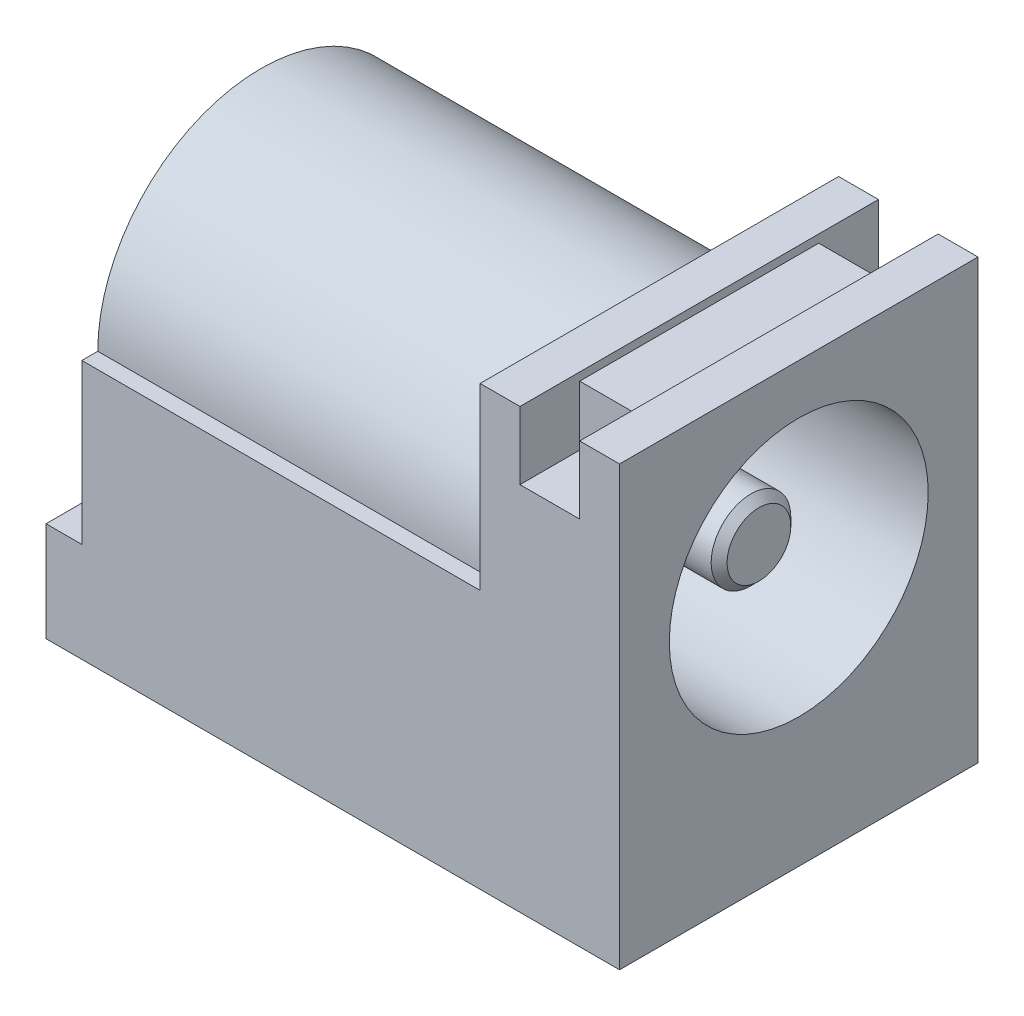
ISO-10303-21;
HEADER;
FILE_DESCRIPTION(('STEP AP214'),'2;1');
FILE_NAME('part.step','',(''),(''),'','','');
FILE_SCHEMA(('AUTOMOTIVE_DESIGN { 1 0 10303 214 1 1 1 1 }'));
ENDSEC;
DATA;
#1=APPLICATION_CONTEXT('core data for automotive mechanical design processes');
#2=APPLICATION_PROTOCOL_DEFINITION('international standard','automotive_design',2000,#1);
#3=PRODUCT_CONTEXT('',#1,'mechanical');
#4=PRODUCT('Part','Part','',(#3));
#5=PRODUCT_RELATED_PRODUCT_CATEGORY('part','',(#4));
#6=PRODUCT_DEFINITION_FORMATION('','',#4);
#7=PRODUCT_DEFINITION_CONTEXT('part definition',#1,'design');
#8=PRODUCT_DEFINITION('design','',#6,#7);
#9=PRODUCT_DEFINITION_SHAPE('','',#8);
#10=(LENGTH_UNIT() NAMED_UNIT(*) SI_UNIT(.MILLI.,.METRE.));
#11=(NAMED_UNIT(*) PLANE_ANGLE_UNIT() SI_UNIT($,.RADIAN.));
#12=(NAMED_UNIT(*) SI_UNIT($,.STERADIAN.) SOLID_ANGLE_UNIT());
#13=UNCERTAINTY_MEASURE_WITH_UNIT(LENGTH_MEASURE(1.E-05),#10,'distance_accuracy_value','');
#14=(GEOMETRIC_REPRESENTATION_CONTEXT(3) GLOBAL_UNCERTAINTY_ASSIGNED_CONTEXT((#13)) GLOBAL_UNIT_ASSIGNED_CONTEXT((#10,
#11,#12)) REPRESENTATION_CONTEXT('',''));
#15=CARTESIAN_POINT('',(0.,0.,0.));
#16=DIRECTION('',(0.,0.,1.));
#17=DIRECTION('',(1.,0.,0.));
#18=AXIS2_PLACEMENT_3D('',#15,#16,#17);
#19=CARTESIAN_POINT('',(-1.,0.,0.));
#20=DIRECTION('',(1.,0.,0.));
#21=DIRECTION('',(0.,0.,-1.));
#22=AXIS2_PLACEMENT_3D('',#19,#20,#21);
#23=PLANE('',#22);
#24=CARTESIAN_POINT('',(-0.999999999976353,0.,0.));
#25=DIRECTION('',(-1.,0.,0.));
#26=DIRECTION('',(0.,0.,1.));
#27=AXIS2_PLACEMENT_3D('',#24,#25,#26);
#28=CIRCLE('',#27,0.800000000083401);
#29=CARTESIAN_POINT('',(-0.999999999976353,0.,0.800000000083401));
#30=VERTEX_POINT('',#29);
#31=EDGE_CURVE('E20',#30,#30,#28,.T.);
#32=ORIENTED_EDGE('',*,*,#31,.F.);
#33=EDGE_LOOP('',(#32));
#34=FACE_BOUND('',#33,.T.);
#35=ADVANCED_FACE('F17',(#34),#23,.T.);
#36=CARTESIAN_POINT('',(-13.52,-10.,1.5));
#37=DIRECTION('',(-1.,0.,0.));
#38=DIRECTION('',(0.,0.,1.));
#39=AXIS2_PLACEMENT_3D('',#36,#37,#38);
#40=PLANE('',#39);
#41=DIRECTION('',(0.,1.,0.));
#42=VECTOR('',#41,1.);
#43=CARTESIAN_POINT('',(-13.52,-10.,-0.5));
#44=LINE('',#43,#42);
#45=CARTESIAN_POINT('',(-13.52,-9.5,-0.5));
#46=VERTEX_POINT('',#45);
#47=CARTESIAN_POINT('',(-13.52,-6.5,-0.5));
#48=VERTEX_POINT('',#47);
#49=EDGE_CURVE('E259',#46,#48,#44,.T.);
#50=ORIENTED_EDGE('',*,*,#49,.T.);
#51=DIRECTION('',(0.,0.,1.));
#52=VECTOR('',#51,1.);
#53=CARTESIAN_POINT('',(-13.52,-6.5,1.5));
#54=LINE('',#53,#52);
#55=CARTESIAN_POINT('',(-13.52,-6.5,0.5));
#56=VERTEX_POINT('',#55);
#57=EDGE_CURVE('E159',#56,#48,#54,.F.);
#58=ORIENTED_EDGE('',*,*,#57,.F.);
#59=DIRECTION('',(0.,1.,0.));
#60=VECTOR('',#59,1.);
#61=CARTESIAN_POINT('',(-13.52,-10.,0.5));
#62=LINE('',#61,#60);
#63=CARTESIAN_POINT('',(-13.52,-9.5,0.5));
#64=VERTEX_POINT('',#63);
#65=EDGE_CURVE('E156',#56,#64,#62,.F.);
#66=ORIENTED_EDGE('',*,*,#65,.T.);
#67=CARTESIAN_POINT('',(-13.52,-9.5,0.));
#68=DIRECTION('',(-1.,0.,0.));
#69=DIRECTION('',(0.,0.,1.));
#70=AXIS2_PLACEMENT_3D('',#67,#68,#69);
#71=CIRCLE('',#70,0.5);
#72=EDGE_CURVE('E124',#46,#64,#71,.T.);
#73=ORIENTED_EDGE('',*,*,#72,.F.);
#74=EDGE_LOOP('',(#50,#58,#66,#73));
#75=FACE_BOUND('',#74,.T.);
#76=ADVANCED_FACE('F158',(#75),#40,.F.);
#77=CARTESIAN_POINT('',(-1.19999999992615,0.,0.));
#78=DIRECTION('',(-1.,0.,0.));
#79=DIRECTION('',(0.,0.,1.));
#80=AXIS2_PLACEMENT_3D('',#77,#78,#79);
#81=CONICAL_SURFACE('',#80,1.0000000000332,0.785398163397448);
#82=ORIENTED_EDGE('',*,*,#31,.T.);
#83=EDGE_LOOP('',(#82));
#84=FACE_BOUND('',#83,.T.);
#85=CARTESIAN_POINT('',(-1.2,0.,0.));
#86=DIRECTION('',(-1.,0.,0.));
#87=DIRECTION('',(0.,0.,1.));
#88=AXIS2_PLACEMENT_3D('',#85,#86,#87);
#89=CIRCLE('',#88,1.);
#90=CARTESIAN_POINT('',(-1.2,0.,1.));
#91=VERTEX_POINT('',#90);
#92=EDGE_CURVE('E262',#91,#91,#89,.T.);
#93=ORIENTED_EDGE('',*,*,#92,.F.);
#94=EDGE_LOOP('',(#93));
#95=FACE_BOUND('',#94,.T.);
#96=ADVANCED_FACE('F1084',(#84,#95),#81,.T.);
#97=CARTESIAN_POINT('',(-8.74181735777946,-10.,0.5));
#98=DIRECTION('',(0.,0.,-1.));
#99=DIRECTION('',(-1.,0.,0.));
#100=AXIS2_PLACEMENT_3D('',#97,#98,#99);
#101=PLANE('',#100);
#102=DIRECTION('',(-1.,0.,0.));
#103=VECTOR('',#102,1.);
#104=CARTESIAN_POINT('',(-13.88,-9.5,0.5));
#105=LINE('',#104,#103);
#106=CARTESIAN_POINT('',(-13.88,-9.5,0.5));
#107=VERTEX_POINT('',#106);
#108=EDGE_CURVE('E163',#64,#107,#105,.T.);
#109=ORIENTED_EDGE('',*,*,#108,.F.);
#110=ORIENTED_EDGE('',*,*,#65,.F.);
#111=DIRECTION('',(0.,1.,0.));
#112=VECTOR('',#111,1.);
#113=CARTESIAN_POINT('',(-13.52,-10.,0.5));
#114=LINE('',#113,#112);
#115=CARTESIAN_POINT('',(-13.52,-6.4,0.5));
#116=VERTEX_POINT('',#115);
#117=EDGE_CURVE('E152',#116,#56,#114,.F.);
#118=ORIENTED_EDGE('',*,*,#117,.F.);
#119=DIRECTION('',(-1.,0.,0.));
#120=VECTOR('',#119,1.);
#121=CARTESIAN_POINT('',(-8.74181735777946,-6.4,0.5));
#122=LINE('',#121,#120);
#123=CARTESIAN_POINT('',(-13.88,-6.4,0.5));
#124=VERTEX_POINT('',#123);
#125=EDGE_CURVE('E247',#124,#116,#122,.F.);
#126=ORIENTED_EDGE('',*,*,#125,.F.);
#127=DIRECTION('',(0.,1.,0.));
#128=VECTOR('',#127,1.);
#129=CARTESIAN_POINT('',(-13.88,-10.,0.5));
#130=LINE('',#129,#128);
#131=EDGE_CURVE('E166',#124,#107,#130,.F.);
#132=ORIENTED_EDGE('',*,*,#131,.T.);
#133=EDGE_LOOP('',(#109,#110,#118,#126,#132));
#134=FACE_BOUND('',#133,.T.);
#135=ADVANCED_FACE('F164',(#134),#101,.F.);
#136=CARTESIAN_POINT('',(-13.88,-9.5,0.));
#137=DIRECTION('',(-1.,0.,0.));
#138=DIRECTION('',(0.,0.,1.));
#139=AXIS2_PLACEMENT_3D('',#136,#137,#138);
#140=CYLINDRICAL_SURFACE('',#139,0.5);
#141=CARTESIAN_POINT('',(-13.88,-9.5,0.));
#142=DIRECTION('',(-1.,0.,0.));
#143=DIRECTION('',(0.,0.,1.));
#144=AXIS2_PLACEMENT_3D('',#141,#142,#143);
#145=CIRCLE('',#144,0.5);
#146=CARTESIAN_POINT('',(-13.88,-9.5,-0.5));
#147=VERTEX_POINT('',#146);
#148=EDGE_CURVE('E175',#107,#147,#145,.F.);
#149=ORIENTED_EDGE('',*,*,#148,.T.);
#150=DIRECTION('',(1.,0.,0.));
#151=VECTOR('',#150,1.);
#152=CARTESIAN_POINT('',(-8.74181735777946,-9.5,-0.5));
#153=LINE('',#152,#151);
#154=EDGE_CURVE('E172',#147,#46,#153,.T.);
#155=ORIENTED_EDGE('',*,*,#154,.T.);
#156=ORIENTED_EDGE('',*,*,#72,.T.);
#157=ORIENTED_EDGE('',*,*,#108,.T.);
#158=EDGE_LOOP('',(#149,#155,#156,#157));
#159=FACE_BOUND('',#158,.T.);
#160=ADVANCED_FACE('F170',(#159),#140,.T.);
#161=CARTESIAN_POINT('',(-8.74181735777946,-10.,-0.5));
#162=DIRECTION('',(0.,0.,1.));
#163=DIRECTION('',(1.,0.,0.));
#164=AXIS2_PLACEMENT_3D('',#161,#162,#163);
#165=PLANE('',#164);
#166=ORIENTED_EDGE('',*,*,#154,.F.);
#167=DIRECTION('',(0.,1.,0.));
#168=VECTOR('',#167,1.);
#169=CARTESIAN_POINT('',(-13.88,-10.,-0.5));
#170=LINE('',#169,#168);
#171=CARTESIAN_POINT('',(-13.88,-6.4,-0.5));
#172=VERTEX_POINT('',#171);
#173=EDGE_CURVE('E177',#147,#172,#170,.T.);
#174=ORIENTED_EDGE('',*,*,#173,.T.);
#175=DIRECTION('',(1.,0.,0.));
#176=VECTOR('',#175,1.);
#177=CARTESIAN_POINT('',(-8.74181735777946,-6.4,-0.5));
#178=LINE('',#177,#176);
#179=CARTESIAN_POINT('',(-13.52,-6.4,-0.5));
#180=VERTEX_POINT('',#179);
#181=EDGE_CURVE('E253',#180,#172,#178,.F.);
#182=ORIENTED_EDGE('',*,*,#181,.F.);
#183=DIRECTION('',(0.,1.,0.));
#184=VECTOR('',#183,1.);
#185=CARTESIAN_POINT('',(-13.52,-10.,-0.5));
#186=LINE('',#185,#184);
#187=EDGE_CURVE('E133',#48,#180,#186,.T.);
#188=ORIENTED_EDGE('',*,*,#187,.F.);
#189=ORIENTED_EDGE('',*,*,#49,.F.);
#190=EDGE_LOOP('',(#166,#174,#182,#188,#189));
#191=FACE_BOUND('',#190,.T.);
#192=ADVANCED_FACE('F900',(#191),#165,.F.);
#193=CARTESIAN_POINT('',(0.,-6.5,0.49999999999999));
#194=DIRECTION('',(0.,0.,-1.));
#195=DIRECTION('',(-1.,0.,0.));
#196=AXIS2_PLACEMENT_3D('',#193,#194,#195);
#197=PLANE('',#196);
#198=DIRECTION('',(-1.,0.,0.));
#199=VECTOR('',#198,1.);
#200=CARTESIAN_POINT('',(0.,-9.5,0.49999999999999));
#201=LINE('',#200,#199);
#202=CARTESIAN_POINT('',(-7.575,-9.5,0.499999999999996));
#203=VERTEX_POINT('',#202);
#204=CARTESIAN_POINT('',(-7.82500000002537,-9.5,0.499999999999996));
#205=VERTEX_POINT('',#204);
#206=EDGE_CURVE('E181',#203,#205,#201,.T.);
#207=ORIENTED_EDGE('',*,*,#206,.F.);
#208=DIRECTION('',(0.,1.,0.));
#209=VECTOR('',#208,1.);
#210=CARTESIAN_POINT('',(-7.575,-10.,0.499999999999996));
#211=LINE('',#210,#209);
#212=CARTESIAN_POINT('',(-7.575,-6.5,0.499999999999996));
#213=VERTEX_POINT('',#212);
#214=EDGE_CURVE('E189',#203,#213,#211,.T.);
#215=ORIENTED_EDGE('',*,*,#214,.T.);
#216=DIRECTION('',(-1.,0.,0.));
#217=VECTOR('',#216,1.);
#218=CARTESIAN_POINT('',(0.,-6.5,0.49999999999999));
#219=LINE('',#218,#217);
#220=CARTESIAN_POINT('',(-7.82500000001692,-6.5,0.499999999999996));
#221=VERTEX_POINT('',#220);
#222=EDGE_CURVE('E261',#221,#213,#219,.F.);
#223=ORIENTED_EDGE('',*,*,#222,.F.);
#224=DIRECTION('',(0.,1.,0.));
#225=VECTOR('',#224,1.);
#226=CARTESIAN_POINT('',(-7.825,-10.,0.499999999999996));
#227=LINE('',#226,#225);
#228=EDGE_CURVE('E182',#221,#205,#227,.F.);
#229=ORIENTED_EDGE('',*,*,#228,.T.);
#230=EDGE_LOOP('',(#207,#215,#223,#229));
#231=FACE_BOUND('',#230,.T.);
#232=ADVANCED_FACE('F1041',(#231),#197,.F.);
#233=CARTESIAN_POINT('',(-7.,0.,0.));
#234=DIRECTION('',(-1.,0.,0.));
#235=DIRECTION('',(0.,0.,1.));
#236=AXIS2_PLACEMENT_3D('',#233,#234,#235);
#237=CYLINDRICAL_SURFACE('',#236,1.);
#238=CARTESIAN_POINT('',(-7.,0.,0.));
#239=DIRECTION('',(-1.,0.,0.));
#240=DIRECTION('',(0.,0.,1.));
#241=AXIS2_PLACEMENT_3D('',#238,#239,#240);
#242=CIRCLE('',#241,1.);
#243=CARTESIAN_POINT('',(-7.,0.,1.));
#244=VERTEX_POINT('',#243);
#245=EDGE_CURVE('E190',#244,#244,#242,.T.);
#246=ORIENTED_EDGE('',*,*,#245,.F.);
#247=EDGE_LOOP('',(#246));
#248=FACE_BOUND('',#247,.T.);
#249=ORIENTED_EDGE('',*,*,#92,.T.);
#250=EDGE_LOOP('',(#249));
#251=FACE_BOUND('',#250,.T.);
#252=ADVANCED_FACE('F1073',(#248,#251),#237,.T.);
#253=CARTESIAN_POINT('',(-13.88,-10.,1.5));
#254=DIRECTION('',(1.,0.,0.));
#255=DIRECTION('',(0.,0.,-1.));
#256=AXIS2_PLACEMENT_3D('',#253,#254,#255);
#257=PLANE('',#256);
#258=DIRECTION('',(0.,0.,-1.));
#259=VECTOR('',#258,1.);
#260=CARTESIAN_POINT('',(-13.88,1.62,-1.5));
#261=LINE('',#260,#259);
#262=CARTESIAN_POINT('',(-13.88,1.62,-1.5));
#263=VERTEX_POINT('',#262);
#264=CARTESIAN_POINT('',(-13.88,1.62,1.5));
#265=VERTEX_POINT('',#264);
#266=EDGE_CURVE('E193',#263,#265,#261,.F.);
#267=ORIENTED_EDGE('',*,*,#266,.F.);
#268=DIRECTION('',(0.,1.,0.));
#269=VECTOR('',#268,1.);
#270=CARTESIAN_POINT('',(-13.88,-10.,-1.5));
#271=LINE('',#270,#269);
#272=CARTESIAN_POINT('',(-13.88,-4.,-1.5));
#273=VERTEX_POINT('',#272);
#274=EDGE_CURVE('E198',#263,#273,#271,.F.);
#275=ORIENTED_EDGE('',*,*,#274,.T.);
#276=DIRECTION('',(0.,1.,0.));
#277=VECTOR('',#276,1.);
#278=CARTESIAN_POINT('',(-13.88,-10.,-1.5));
#279=LINE('',#278,#277);
#280=CARTESIAN_POINT('',(-13.88,-5.32763128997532,-1.5));
#281=VERTEX_POINT('',#280);
#282=EDGE_CURVE('E278',#281,#273,#279,.T.);
#283=ORIENTED_EDGE('',*,*,#282,.F.);
#284=DIRECTION('',(0.,-0.731353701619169,0.6819983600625));
#285=VECTOR('',#284,1.);
#286=CARTESIAN_POINT('',(-13.88,-6.4,-0.5));
#287=LINE('',#286,#285);
#288=EDGE_CURVE('E289',#281,#172,#287,.T.);
#289=ORIENTED_EDGE('',*,*,#288,.T.);
#290=ORIENTED_EDGE('',*,*,#173,.F.);
#291=ORIENTED_EDGE('',*,*,#148,.F.);
#292=ORIENTED_EDGE('',*,*,#131,.F.);
#293=DIRECTION('',(0.,0.731353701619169,0.6819983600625));
#294=VECTOR('',#293,1.);
#295=CARTESIAN_POINT('',(-13.88,-6.4,0.5));
#296=LINE('',#295,#294);
#297=CARTESIAN_POINT('',(-13.88,-5.32763128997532,1.5));
#298=VERTEX_POINT('',#297);
#299=EDGE_CURVE('E274',#124,#298,#296,.T.);
#300=ORIENTED_EDGE('',*,*,#299,.T.);
#301=DIRECTION('',(0.,1.,0.));
#302=VECTOR('',#301,1.);
#303=CARTESIAN_POINT('',(-13.88,-10.,1.5));
#304=LINE('',#303,#302);
#305=CARTESIAN_POINT('',(-13.88,-4.,1.5));
#306=VERTEX_POINT('',#305);
#307=EDGE_CURVE('E265',#306,#298,#304,.F.);
#308=ORIENTED_EDGE('',*,*,#307,.F.);
#309=DIRECTION('',(0.,1.,0.));
#310=VECTOR('',#309,1.);
#311=CARTESIAN_POINT('',(-13.88,-10.,1.5));
#312=LINE('',#311,#310);
#313=EDGE_CURVE('E203',#306,#265,#312,.T.);
#314=ORIENTED_EDGE('',*,*,#313,.T.);
#315=EDGE_LOOP('',(#267,#275,#283,#289,#290,#291,#292,#300,#308,#314));
#316=FACE_BOUND('',#315,.T.);
#317=ADVANCED_FACE('F903',(#316),#257,.F.);
#318=CARTESIAN_POINT('',(-8.74181735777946,-6.4,0.5));
#319=DIRECTION('',(0.,0.6819983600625,-0.731353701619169));
#320=DIRECTION('',(0.,0.731353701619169,0.6819983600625));
#321=AXIS2_PLACEMENT_3D('',#318,#319,#320);
#322=PLANE('',#321);
#323=DIRECTION('',(1.,0.,0.));
#324=VECTOR('',#323,1.);
#325=CARTESIAN_POINT('',(-8.74181735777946,-5.32763128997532,1.5));
#326=LINE('',#325,#324);
#327=CARTESIAN_POINT('',(-13.52,-5.32763128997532,1.5));
#328=VERTEX_POINT('',#327);
#329=EDGE_CURVE('E268',#328,#298,#326,.F.);
#330=ORIENTED_EDGE('',*,*,#329,.T.);
#331=ORIENTED_EDGE('',*,*,#299,.F.);
#332=ORIENTED_EDGE('',*,*,#125,.T.);
#333=DIRECTION('',(0.,-0.731353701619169,-0.6819983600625));
#334=VECTOR('',#333,1.);
#335=CARTESIAN_POINT('',(-13.52,-5.32763128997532,1.5));
#336=LINE('',#335,#334);
#337=EDGE_CURVE('E240',#328,#116,#336,.T.);
#338=ORIENTED_EDGE('',*,*,#337,.F.);
#339=EDGE_LOOP('',(#330,#331,#332,#338));
#340=FACE_BOUND('',#339,.T.);
#341=ADVANCED_FACE('F1067',(#340),#322,.F.);
#342=CARTESIAN_POINT('',(-8.74181735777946,-6.4,-0.5));
#343=DIRECTION('',(0.,0.6819983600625,0.731353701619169));
#344=DIRECTION('',(0.,-0.731353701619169,0.6819983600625));
#345=AXIS2_PLACEMENT_3D('',#342,#343,#344);
#346=PLANE('',#345);
#347=ORIENTED_EDGE('',*,*,#181,.T.);
#348=ORIENTED_EDGE('',*,*,#288,.F.);
#349=DIRECTION('',(1.,0.,0.));
#350=VECTOR('',#349,1.);
#351=CARTESIAN_POINT('',(-8.74181735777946,-5.32763128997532,-1.5));
#352=LINE('',#351,#350);
#353=CARTESIAN_POINT('',(-13.52,-5.32763128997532,-1.5));
#354=VERTEX_POINT('',#353);
#355=EDGE_CURVE('E277',#354,#281,#352,.F.);
#356=ORIENTED_EDGE('',*,*,#355,.F.);
#357=DIRECTION('',(0.,0.731353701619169,-0.6819983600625));
#358=VECTOR('',#357,1.);
#359=CARTESIAN_POINT('',(-13.52,-6.4,-0.5));
#360=LINE('',#359,#358);
#361=EDGE_CURVE('E242',#180,#354,#360,.T.);
#362=ORIENTED_EDGE('',*,*,#361,.F.);
#363=EDGE_LOOP('',(#347,#348,#356,#362));
#364=FACE_BOUND('',#363,.T.);
#365=ADVANCED_FACE('F897',(#364),#346,.F.);
#366=CARTESIAN_POINT('',(-10.2,-7.00427653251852,-0.626693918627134));
#367=DIRECTION('',(-1.,0.,0.));
#368=DIRECTION('',(0.,0.,1.));
#369=AXIS2_PLACEMENT_3D('',#366,#367,#368);
#370=PLANE('',#369);
#371=DIRECTION('',(0.,0.,1.));
#372=VECTOR('',#371,1.);
#373=CARTESIAN_POINT('',(-10.2,-9.5,-4.5));
#374=LINE('',#373,#372);
#375=CARTESIAN_POINT('',(-10.2,-9.5,-4.9));
#376=VERTEX_POINT('',#375);
#377=CARTESIAN_POINT('',(-10.2,-9.5,-4.5));
#378=VERTEX_POINT('',#377);
#379=EDGE_CURVE('E332',#376,#378,#374,.T.);
#380=ORIENTED_EDGE('',*,*,#379,.F.);
#381=DIRECTION('',(0.,1.,0.));
#382=VECTOR('',#381,1.);
#383=CARTESIAN_POINT('',(-10.2,-10.,-4.9));
#384=LINE('',#383,#382);
#385=CARTESIAN_POINT('',(-10.2,-7.00427653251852,-4.9));
#386=VERTEX_POINT('',#385);
#387=EDGE_CURVE('E207',#376,#386,#384,.T.);
#388=ORIENTED_EDGE('',*,*,#387,.T.);
#389=DIRECTION('',(0.,0.,1.));
#390=VECTOR('',#389,1.);
#391=CARTESIAN_POINT('',(-10.2,-7.00427653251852,-0.626693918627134));
#392=LINE('',#391,#390);
#393=CARTESIAN_POINT('',(-10.2,-7.00427653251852,-4.5));
#394=VERTEX_POINT('',#393);
#395=EDGE_CURVE('E292',#394,#386,#392,.F.);
#396=ORIENTED_EDGE('',*,*,#395,.F.);
#397=DIRECTION('',(0.,1.,0.));
#398=VECTOR('',#397,1.);
#399=CARTESIAN_POINT('',(-10.2,-10.,-4.5));
#400=LINE('',#399,#398);
#401=EDGE_CURVE('E212',#394,#378,#400,.F.);
#402=ORIENTED_EDGE('',*,*,#401,.T.);
#403=EDGE_LOOP('',(#380,#388,#396,#402));
#404=FACE_BOUND('',#403,.T.);
#405=ADVANCED_FACE('F1060',(#404),#370,.F.);
#406=CARTESIAN_POINT('',(-10.7,-9.5,-4.5));
#407=DIRECTION('',(0.,0.,1.));
#408=DIRECTION('',(1.,0.,0.));
#409=AXIS2_PLACEMENT_3D('',#406,#407,#408);
#410=CYLINDRICAL_SURFACE('',#409,0.5);
#411=DIRECTION('',(0.,0.,1.));
#412=VECTOR('',#411,1.);
#413=CARTESIAN_POINT('',(-11.2,-9.5,-0.626693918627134));
#414=LINE('',#413,#412);
#415=CARTESIAN_POINT('',(-11.2,-9.5,-4.5));
#416=VERTEX_POINT('',#415);
#417=CARTESIAN_POINT('',(-11.2,-9.5,-4.9));
#418=VERTEX_POINT('',#417);
#419=EDGE_CURVE('E340',#416,#418,#414,.F.);
#420=ORIENTED_EDGE('',*,*,#419,.T.);
#421=CARTESIAN_POINT('',(-10.7,-9.5,-4.9));
#422=DIRECTION('',(0.,0.,1.));
#423=DIRECTION('',(1.,0.,0.));
#424=AXIS2_PLACEMENT_3D('',#421,#422,#423);
#425=CIRCLE('',#424,0.5);
#426=EDGE_CURVE('E204',#418,#376,#425,.T.);
#427=ORIENTED_EDGE('',*,*,#426,.T.);
#428=ORIENTED_EDGE('',*,*,#379,.T.);
#429=CARTESIAN_POINT('',(-10.7,-9.5,-4.5));
#430=DIRECTION('',(0.,0.,1.));
#431=DIRECTION('',(1.,0.,0.));
#432=AXIS2_PLACEMENT_3D('',#429,#430,#431);
#433=CIRCLE('',#432,0.5);
#434=EDGE_CURVE('E209',#378,#416,#433,.F.);
#435=ORIENTED_EDGE('',*,*,#434,.T.);
#436=EDGE_LOOP('',(#420,#427,#428,#435));
#437=FACE_BOUND('',#436,.T.);
#438=ADVANCED_FACE('F1053',(#437),#410,.T.);
#439=CARTESIAN_POINT('',(-11.2,-7.00427653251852,-0.626693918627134));
#440=DIRECTION('',(1.,0.,0.));
#441=DIRECTION('',(0.,1.,0.));
#442=AXIS2_PLACEMENT_3D('',#439,#440,#441);
#443=PLANE('',#442);
#444=ORIENTED_EDGE('',*,*,#419,.F.);
#445=DIRECTION('',(0.,1.,0.));
#446=VECTOR('',#445,1.);
#447=CARTESIAN_POINT('',(-11.2,-10.,-4.5));
#448=LINE('',#447,#446);
#449=CARTESIAN_POINT('',(-11.2,-7.00427653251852,-4.5));
#450=VERTEX_POINT('',#449);
#451=EDGE_CURVE('E211',#416,#450,#448,.T.);
#452=ORIENTED_EDGE('',*,*,#451,.T.);
#453=DIRECTION('',(0.,0.,1.));
#454=VECTOR('',#453,1.);
#455=CARTESIAN_POINT('',(-11.2,-7.00427653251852,-0.626693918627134));
#456=LINE('',#455,#454);
#457=CARTESIAN_POINT('',(-11.2,-7.00427653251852,-4.9));
#458=VERTEX_POINT('',#457);
#459=EDGE_CURVE('E335',#458,#450,#456,.T.);
#460=ORIENTED_EDGE('',*,*,#459,.F.);
#461=DIRECTION('',(0.,1.,0.));
#462=VECTOR('',#461,1.);
#463=CARTESIAN_POINT('',(-11.2,-10.,-4.9));
#464=LINE('',#463,#462);
#465=EDGE_CURVE('E208',#458,#418,#464,.F.);
#466=ORIENTED_EDGE('',*,*,#465,.T.);
#467=EDGE_LOOP('',(#444,#452,#460,#466));
#468=FACE_BOUND('',#467,.T.);
#469=ADVANCED_FACE('F1046',(#468),#443,.F.);
#470=CARTESIAN_POINT('',(-7.825,-10.,1.25));
#471=DIRECTION('',(1.,0.,0.));
#472=DIRECTION('',(0.,0.,-1.));
#473=AXIS2_PLACEMENT_3D('',#470,#471,#472);
#474=PLANE('',#473);
#475=ORIENTED_EDGE('',*,*,#228,.F.);
#476=DIRECTION('',(0.,0.,-1.));
#477=VECTOR('',#476,1.);
#478=CARTESIAN_POINT('',(-7.825,-6.5,1.25));
#479=LINE('',#478,#477);
#480=CARTESIAN_POINT('',(-7.82500000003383,-6.5,-0.500000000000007));
#481=VERTEX_POINT('',#480);
#482=EDGE_CURVE('E342',#481,#221,#479,.F.);
#483=ORIENTED_EDGE('',*,*,#482,.F.);
#484=DIRECTION('',(0.,-1.,0.));
#485=VECTOR('',#484,1.);
#486=CARTESIAN_POINT('',(-7.82500000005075,-10.,-0.50000000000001));
#487=LINE('',#486,#485);
#488=CARTESIAN_POINT('',(-7.82500000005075,-9.5,-0.50000000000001));
#489=VERTEX_POINT('',#488);
#490=EDGE_CURVE('E352',#481,#489,#487,.T.);
#491=ORIENTED_EDGE('',*,*,#490,.T.);
#492=CARTESIAN_POINT('',(-7.82500000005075,-9.5,0.));
#493=DIRECTION('',(-1.,0.,0.));
#494=DIRECTION('',(0.,0.,1.));
#495=AXIS2_PLACEMENT_3D('',#492,#493,#494);
#496=CIRCLE('',#495,0.5);
#497=EDGE_CURVE('E178',#205,#489,#496,.F.);
#498=ORIENTED_EDGE('',*,*,#497,.F.);
#499=EDGE_LOOP('',(#475,#483,#491,#498));
#500=FACE_BOUND('',#499,.T.);
#501=ADVANCED_FACE('F1044',(#500),#474,.F.);
#502=CARTESIAN_POINT('',(0.,-9.5,0.));
#503=DIRECTION('',(-1.,0.,0.));
#504=DIRECTION('',(0.,0.,1.));
#505=AXIS2_PLACEMENT_3D('',#502,#503,#504);
#506=CYLINDRICAL_SURFACE('',#505,0.5);
#507=CARTESIAN_POINT('',(-7.575,-9.5,0.));
#508=DIRECTION('',(-1.,0.,0.));
#509=DIRECTION('',(0.,0.,1.));
#510=AXIS2_PLACEMENT_3D('',#507,#508,#509);
#511=CIRCLE('',#510,0.5);
#512=CARTESIAN_POINT('',(-7.575,-9.5,-0.50000000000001));
#513=VERTEX_POINT('',#512);
#514=EDGE_CURVE('E186',#513,#203,#511,.T.);
#515=ORIENTED_EDGE('',*,*,#514,.T.);
#516=ORIENTED_EDGE('',*,*,#206,.T.);
#517=ORIENTED_EDGE('',*,*,#497,.T.);
#518=DIRECTION('',(1.,0.,0.));
#519=VECTOR('',#518,1.);
#520=CARTESIAN_POINT('',(0.,-9.5,-0.50000000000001));
#521=LINE('',#520,#519);
#522=EDGE_CURVE('E354',#489,#513,#521,.T.);
#523=ORIENTED_EDGE('',*,*,#522,.T.);
#524=EDGE_LOOP('',(#515,#516,#517,#523));
#525=FACE_BOUND('',#524,.T.);
#526=ADVANCED_FACE('F1034',(#525),#506,.T.);
#527=CARTESIAN_POINT('',(-7.575,-10.,1.25));
#528=DIRECTION('',(-1.,0.,0.));
#529=DIRECTION('',(0.,0.,1.));
#530=AXIS2_PLACEMENT_3D('',#527,#528,#529);
#531=PLANE('',#530);
#532=ORIENTED_EDGE('',*,*,#514,.F.);
#533=DIRECTION('',(0.,-1.,0.));
#534=VECTOR('',#533,1.);
#535=CARTESIAN_POINT('',(-7.575,-10.,-0.50000000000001));
#536=LINE('',#535,#534);
#537=CARTESIAN_POINT('',(-7.575,-6.5,-0.500000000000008));
#538=VERTEX_POINT('',#537);
#539=EDGE_CURVE('E368',#513,#538,#536,.F.);
#540=ORIENTED_EDGE('',*,*,#539,.T.);
#541=DIRECTION('',(0.,0.,1.));
#542=VECTOR('',#541,1.);
#543=CARTESIAN_POINT('',(-7.575,-6.5,1.25));
#544=LINE('',#543,#542);
#545=EDGE_CURVE('E185',#213,#538,#544,.F.);
#546=ORIENTED_EDGE('',*,*,#545,.F.);
#547=ORIENTED_EDGE('',*,*,#214,.F.);
#548=EDGE_LOOP('',(#532,#540,#546,#547));
#549=FACE_BOUND('',#548,.T.);
#550=ADVANCED_FACE('F1038',(#549),#531,.F.);
#551=CARTESIAN_POINT('',(-1.,2.8,-4.49999999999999));
#552=DIRECTION('',(1.,0.,0.));
#553=DIRECTION('',(0.,0.,-1.));
#554=AXIS2_PLACEMENT_3D('',#551,#552,#553);
#555=PLANE('',#554);
#556=DIRECTION('',(0.,1.,0.));
#557=VECTOR('',#556,1.);
#558=CARTESIAN_POINT('',(-1.,2.8,-4.5));
#559=LINE('',#558,#557);
#560=CARTESIAN_POINT('',(-1.,2.8,-4.5));
#561=VERTEX_POINT('',#560);
#562=CARTESIAN_POINT('',(-1.,4.5,-4.5));
#563=VERTEX_POINT('',#562);
#564=EDGE_CURVE('E194',#561,#563,#559,.T.);
#565=ORIENTED_EDGE('',*,*,#564,.F.);
#566=DIRECTION('',(0.,0.,-1.));
#567=VECTOR('',#566,1.);
#568=CARTESIAN_POINT('',(-1.,2.8,-4.49999999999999));
#569=LINE('',#568,#567);
#570=CARTESIAN_POINT('',(-1.,2.8,-2.99999999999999));
#571=VERTEX_POINT('',#570);
#572=EDGE_CURVE('E386',#571,#561,#569,.T.);
#573=ORIENTED_EDGE('',*,*,#572,.F.);
#574=DIRECTION('',(0.,-1.,0.));
#575=VECTOR('',#574,1.);
#576=CARTESIAN_POINT('',(-1.,2.8,-2.99999999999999));
#577=LINE('',#576,#575);
#578=CARTESIAN_POINT('',(-1.,4.3,-2.99999999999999));
#579=VERTEX_POINT('',#578);
#580=EDGE_CURVE('E503',#571,#579,#577,.F.);
#581=ORIENTED_EDGE('',*,*,#580,.T.);
#582=DIRECTION('',(0.,0.,-1.));
#583=VECTOR('',#582,1.);
#584=CARTESIAN_POINT('',(-1.,4.3,2.99999999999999));
#585=LINE('',#584,#583);
#586=CARTESIAN_POINT('',(-1.,4.3,2.99999999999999));
#587=VERTEX_POINT('',#586);
#588=EDGE_CURVE('E202',#579,#587,#585,.F.);
#589=ORIENTED_EDGE('',*,*,#588,.T.);
#590=DIRECTION('',(0.,1.,0.));
#591=VECTOR('',#590,1.);
#592=CARTESIAN_POINT('',(-1.,2.8,2.99999999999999));
#593=LINE('',#592,#591);
#594=CARTESIAN_POINT('',(-1.,2.8,2.99999999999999));
#595=VERTEX_POINT('',#594);
#596=EDGE_CURVE('E471',#587,#595,#593,.F.);
#597=ORIENTED_EDGE('',*,*,#596,.T.);
#598=DIRECTION('',(0.,0.,-1.));
#599=VECTOR('',#598,1.);
#600=CARTESIAN_POINT('',(-1.,2.8,-4.49999999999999));
#601=LINE('',#600,#599);
#602=CARTESIAN_POINT('',(-1.,2.8,4.5));
#603=VERTEX_POINT('',#602);
#604=EDGE_CURVE('E383',#603,#595,#601,.T.);
#605=ORIENTED_EDGE('',*,*,#604,.F.);
#606=DIRECTION('',(0.,1.,0.));
#607=VECTOR('',#606,1.);
#608=CARTESIAN_POINT('',(-1.,2.8,4.49999999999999));
#609=LINE('',#608,#607);
#610=CARTESIAN_POINT('',(-1.,4.5,4.5));
#611=VERTEX_POINT('',#610);
#612=EDGE_CURVE('E377',#611,#603,#609,.F.);
#613=ORIENTED_EDGE('',*,*,#612,.F.);
#614=DIRECTION('',(0.,0.,1.));
#615=VECTOR('',#614,1.);
#616=CARTESIAN_POINT('',(-0.999999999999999,4.5,4.5));
#617=LINE('',#616,#615);
#618=EDGE_CURVE('E524',#563,#611,#617,.T.);
#619=ORIENTED_EDGE('',*,*,#618,.F.);
#620=EDGE_LOOP('',(#565,#573,#581,#589,#597,#605,#613,#619));
#621=FACE_BOUND('',#620,.T.);
#622=ADVANCED_FACE('F1120',(#621),#555,.F.);
#623=CARTESIAN_POINT('',(-7.,0.,0.));
#624=DIRECTION('',(1.,0.,0.));
#625=DIRECTION('',(0.,0.,-1.));
#626=AXIS2_PLACEMENT_3D('',#623,#624,#625);
#627=PLANE('',#626);
#628=ORIENTED_EDGE('',*,*,#245,.T.);
#629=EDGE_LOOP('',(#628));
#630=FACE_BOUND('',#629,.T.);
#631=CARTESIAN_POINT('',(-7.,0.,0.));
#632=DIRECTION('',(-1.,0.,0.));
#633=DIRECTION('',(0.,0.,1.));
#634=AXIS2_PLACEMENT_3D('',#631,#632,#633);
#635=CIRCLE('',#634,3.25);
#636=CARTESIAN_POINT('',(-7.,0.,3.25));
#637=VERTEX_POINT('',#636);
#638=EDGE_CURVE('E213',#637,#637,#635,.F.);
#639=ORIENTED_EDGE('',*,*,#638,.T.);
#640=EDGE_LOOP('',(#639));
#641=FACE_BOUND('',#640,.T.);
#642=ADVANCED_FACE('F1116',(#630,#641),#627,.T.);
#643=CARTESIAN_POINT('',(-13.38,1.62,-1.5));
#644=DIRECTION('',(0.,0.,-1.));
#645=DIRECTION('',(-1.,0.,0.));
#646=AXIS2_PLACEMENT_3D('',#643,#644,#645);
#647=CYLINDRICAL_SURFACE('',#646,0.5);
#648=CARTESIAN_POINT('',(-13.38,1.62,1.5));
#649=DIRECTION('',(0.,0.,-1.));
#650=DIRECTION('',(-1.,0.,0.));
#651=AXIS2_PLACEMENT_3D('',#648,#649,#650);
#652=CIRCLE('',#651,0.5);
#653=CARTESIAN_POINT('',(-13.52,2.1,1.5));
#654=VERTEX_POINT('',#653);
#655=EDGE_CURVE('E200',#265,#654,#652,.T.);
#656=ORIENTED_EDGE('',*,*,#655,.T.);
#657=DIRECTION('',(0.,0.,1.));
#658=VECTOR('',#657,1.);
#659=CARTESIAN_POINT('',(-13.52,2.1,1.5));
#660=LINE('',#659,#658);
#661=CARTESIAN_POINT('',(-13.52,2.1,-1.5));
#662=VERTEX_POINT('',#661);
#663=EDGE_CURVE('E216',#654,#662,#660,.F.);
#664=ORIENTED_EDGE('',*,*,#663,.T.);
#665=CARTESIAN_POINT('',(-13.38,1.62,-1.5));
#666=DIRECTION('',(0.,0.,-1.));
#667=DIRECTION('',(-1.,0.,0.));
#668=AXIS2_PLACEMENT_3D('',#665,#666,#667);
#669=CIRCLE('',#668,0.5);
#670=EDGE_CURVE('E195',#662,#263,#669,.F.);
#671=ORIENTED_EDGE('',*,*,#670,.T.);
#672=ORIENTED_EDGE('',*,*,#266,.T.);
#673=EDGE_LOOP('',(#656,#664,#671,#672));
#674=FACE_BOUND('',#673,.T.);
#675=ADVANCED_FACE('F1119',(#674),#647,.T.);
#676=CARTESIAN_POINT('',(-13.88,-10.,-1.5));
#677=DIRECTION('',(0.,0.,1.));
#678=DIRECTION('',(1.,0.,0.));
#679=AXIS2_PLACEMENT_3D('',#676,#677,#678);
#680=PLANE('',#679);
#681=ORIENTED_EDGE('',*,*,#670,.F.);
#682=DIRECTION('',(0.,1.,0.));
#683=VECTOR('',#682,1.);
#684=CARTESIAN_POINT('',(-13.52,-10.,-1.5));
#685=LINE('',#684,#683);
#686=CARTESIAN_POINT('',(-13.52,-4.,-1.5));
#687=VERTEX_POINT('',#686);
#688=EDGE_CURVE('E397',#662,#687,#685,.F.);
#689=ORIENTED_EDGE('',*,*,#688,.T.);
#690=DIRECTION('',(1.,0.,0.));
#691=VECTOR('',#690,1.);
#692=CARTESIAN_POINT('',(-13.88,-4.,-1.5));
#693=LINE('',#692,#691);
#694=EDGE_CURVE('E199',#273,#687,#693,.T.);
#695=ORIENTED_EDGE('',*,*,#694,.F.);
#696=ORIENTED_EDGE('',*,*,#274,.F.);
#697=EDGE_LOOP('',(#681,#689,#695,#696));
#698=FACE_BOUND('',#697,.T.);
#699=ADVANCED_FACE('F1513',(#698),#680,.F.);
#700=CARTESIAN_POINT('',(-13.88,-10.,1.5));
#701=DIRECTION('',(0.,0.,-1.));
#702=DIRECTION('',(-1.,0.,0.));
#703=AXIS2_PLACEMENT_3D('',#700,#701,#702);
#704=PLANE('',#703);
#705=ORIENTED_EDGE('',*,*,#655,.F.);
#706=ORIENTED_EDGE('',*,*,#313,.F.);
#707=DIRECTION('',(-1.,0.,0.));
#708=VECTOR('',#707,1.);
#709=CARTESIAN_POINT('',(-13.88,-4.,1.5));
#710=LINE('',#709,#708);
#711=CARTESIAN_POINT('',(-13.52,-4.,1.5));
#712=VERTEX_POINT('',#711);
#713=EDGE_CURVE('E405',#712,#306,#710,.T.);
#714=ORIENTED_EDGE('',*,*,#713,.F.);
#715=DIRECTION('',(0.,1.,0.));
#716=VECTOR('',#715,1.);
#717=CARTESIAN_POINT('',(-13.52,-10.,1.5));
#718=LINE('',#717,#716);
#719=EDGE_CURVE('E400',#712,#654,#718,.T.);
#720=ORIENTED_EDGE('',*,*,#719,.T.);
#721=EDGE_LOOP('',(#705,#706,#714,#720));
#722=FACE_BOUND('',#721,.T.);
#723=ADVANCED_FACE('F1502',(#722),#704,.F.);
#724=CARTESIAN_POINT('',(-1.,4.3,2.99999999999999));
#725=DIRECTION('',(0.,-1.,0.));
#726=DIRECTION('',(0.,0.,-1.));
#727=AXIS2_PLACEMENT_3D('',#724,#725,#726);
#728=PLANE('',#727);
#729=DIRECTION('',(1.,0.,0.));
#730=VECTOR('',#729,1.);
#731=CARTESIAN_POINT('',(-1.,4.3,-2.99999999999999));
#732=LINE('',#731,#730);
#733=CARTESIAN_POINT('',(-2.5,4.3,-2.99999999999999));
#734=VERTEX_POINT('',#733);
#735=EDGE_CURVE('E521',#579,#734,#732,.F.);
#736=ORIENTED_EDGE('',*,*,#735,.T.);
#737=DIRECTION('',(0.,0.,1.));
#738=VECTOR('',#737,1.);
#739=CARTESIAN_POINT('',(-2.5,4.3,-4.49999999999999));
#740=LINE('',#739,#738);
#741=CARTESIAN_POINT('',(-2.5,4.3,2.99999999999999));
#742=VERTEX_POINT('',#741);
#743=EDGE_CURVE('E565',#734,#742,#740,.T.);
#744=ORIENTED_EDGE('',*,*,#743,.T.);
#745=DIRECTION('',(1.,0.,0.));
#746=VECTOR('',#745,1.);
#747=CARTESIAN_POINT('',(-1.,4.3,2.99999999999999));
#748=LINE('',#747,#746);
#749=EDGE_CURVE('E464',#742,#587,#748,.T.);
#750=ORIENTED_EDGE('',*,*,#749,.T.);
#751=ORIENTED_EDGE('',*,*,#588,.F.);
#752=EDGE_LOOP('',(#736,#744,#750,#751));
#753=FACE_BOUND('',#752,.T.);
#754=ADVANCED_FACE('F1491',(#753),#728,.F.);
#755=CARTESIAN_POINT('',(-8.74181735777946,-10.,1.5));
#756=DIRECTION('',(0.,0.,1.));
#757=DIRECTION('',(1.,0.,0.));
#758=AXIS2_PLACEMENT_3D('',#755,#756,#757);
#759=PLANE('',#758);
#760=DIRECTION('',(0.,1.,0.));
#761=VECTOR('',#760,1.);
#762=CARTESIAN_POINT('',(-14.4,-6.5,1.5));
#763=LINE('',#762,#761);
#764=CARTESIAN_POINT('',(-14.4,-6.5,1.5));
#765=VERTEX_POINT('',#764);
#766=CARTESIAN_POINT('',(-14.4,-4.,1.5));
#767=VERTEX_POINT('',#766);
#768=EDGE_CURVE('E549',#765,#767,#763,.T.);
#769=ORIENTED_EDGE('',*,*,#768,.T.);
#770=DIRECTION('',(1.,0.,0.));
#771=VECTOR('',#770,1.);
#772=CARTESIAN_POINT('',(-8.74181735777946,-4.,1.5));
#773=LINE('',#772,#771);
#774=EDGE_CURVE('E271',#306,#767,#773,.F.);
#775=ORIENTED_EDGE('',*,*,#774,.F.);
#776=ORIENTED_EDGE('',*,*,#307,.T.);
#777=ORIENTED_EDGE('',*,*,#329,.F.);
#778=DIRECTION('',(0.,1.,0.));
#779=VECTOR('',#778,1.);
#780=CARTESIAN_POINT('',(-13.52,-10.,1.5));
#781=LINE('',#780,#779);
#782=CARTESIAN_POINT('',(-13.52,-6.5,1.5));
#783=VERTEX_POINT('',#782);
#784=EDGE_CURVE('E243',#783,#328,#781,.T.);
#785=ORIENTED_EDGE('',*,*,#784,.F.);
#786=DIRECTION('',(1.,0.,0.));
#787=VECTOR('',#786,1.);
#788=CARTESIAN_POINT('',(-8.74181735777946,-6.5,1.5));
#789=LINE('',#788,#787);
#790=EDGE_CURVE('E461',#765,#783,#789,.T.);
#791=ORIENTED_EDGE('',*,*,#790,.F.);
#792=EDGE_LOOP('',(#769,#775,#776,#777,#785,#791));
#793=FACE_BOUND('',#792,.T.);
#794=ADVANCED_FACE('F1481',(#793),#759,.F.);
#795=CARTESIAN_POINT('',(-1.,2.8,2.99999999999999));
#796=DIRECTION('',(0.,0.,-1.));
#797=DIRECTION('',(0.,1.,0.));
#798=AXIS2_PLACEMENT_3D('',#795,#796,#797);
#799=PLANE('',#798);
#800=ORIENTED_EDGE('',*,*,#749,.F.);
#801=DIRECTION('',(0.,1.,0.));
#802=VECTOR('',#801,1.);
#803=CARTESIAN_POINT('',(-2.5,2.8,2.99999999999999));
#804=LINE('',#803,#802);
#805=CARTESIAN_POINT('',(-2.5,2.8,2.99999999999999));
#806=VERTEX_POINT('',#805);
#807=EDGE_CURVE('E562',#742,#806,#804,.F.);
#808=ORIENTED_EDGE('',*,*,#807,.T.);
#809=DIRECTION('',(1.,0.,0.));
#810=VECTOR('',#809,1.);
#811=CARTESIAN_POINT('',(-1.,2.8,2.99999999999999));
#812=LINE('',#811,#810);
#813=EDGE_CURVE('E453',#595,#806,#812,.F.);
#814=ORIENTED_EDGE('',*,*,#813,.F.);
#815=ORIENTED_EDGE('',*,*,#596,.F.);
#816=EDGE_LOOP('',(#800,#808,#814,#815));
#817=FACE_BOUND('',#816,.T.);
#818=ADVANCED_FACE('F1470',(#817),#799,.F.);
#819=CARTESIAN_POINT('',(-11.95,-10.,-4.9));
#820=DIRECTION('',(0.,0.,1.));
#821=DIRECTION('',(1.,0.,0.));
#822=AXIS2_PLACEMENT_3D('',#819,#820,#821);
#823=PLANE('',#822);
#824=ORIENTED_EDGE('',*,*,#426,.F.);
#825=ORIENTED_EDGE('',*,*,#465,.F.);
#826=DIRECTION('',(0.681998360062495,-0.731353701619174,0.));
#827=VECTOR('',#826,1.);
#828=CARTESIAN_POINT('',(-11.95,-6.2,-4.9));
#829=LINE('',#828,#827);
#830=CARTESIAN_POINT('',(-11.95,-6.2,-4.9));
#831=VERTEX_POINT('',#830);
#832=EDGE_CURVE('E474',#831,#458,#829,.T.);
#833=ORIENTED_EDGE('',*,*,#832,.F.);
#834=DIRECTION('',(0.,1.,0.));
#835=VECTOR('',#834,1.);
#836=CARTESIAN_POINT('',(-11.95,-10.,-4.9));
#837=LINE('',#836,#835);
#838=CARTESIAN_POINT('',(-11.95,-3.98989794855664,-4.9));
#839=VERTEX_POINT('',#838);
#840=EDGE_CURVE('E225',#831,#839,#837,.T.);
#841=ORIENTED_EDGE('',*,*,#840,.T.);
#842=DIRECTION('',(-1.,0.,0.));
#843=VECTOR('',#842,1.);
#844=CARTESIAN_POINT('',(-11.95,-3.98989794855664,-4.9));
#845=LINE('',#844,#843);
#846=CARTESIAN_POINT('',(-9.45,-3.98989794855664,-4.9));
#847=VERTEX_POINT('',#846);
#848=EDGE_CURVE('E221',#847,#839,#845,.T.);
#849=ORIENTED_EDGE('',*,*,#848,.F.);
#850=DIRECTION('',(0.,1.,0.));
#851=VECTOR('',#850,1.);
#852=CARTESIAN_POINT('',(-9.45,-10.,-4.9));
#853=LINE('',#852,#851);
#854=CARTESIAN_POINT('',(-9.45,-6.2,-4.9));
#855=VERTEX_POINT('',#854);
#856=EDGE_CURVE('E602',#847,#855,#853,.F.);
#857=ORIENTED_EDGE('',*,*,#856,.T.);
#858=DIRECTION('',(-0.681998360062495,-0.731353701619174,0.));
#859=VECTOR('',#858,1.);
#860=CARTESIAN_POINT('',(-10.2,-7.00427653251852,-4.9));
#861=LINE('',#860,#859);
#862=EDGE_CURVE('E452',#855,#386,#861,.T.);
#863=ORIENTED_EDGE('',*,*,#862,.T.);
#864=ORIENTED_EDGE('',*,*,#387,.F.);
#865=EDGE_LOOP('',(#824,#825,#833,#841,#849,#857,#863,#864));
#866=FACE_BOUND('',#865,.T.);
#867=ADVANCED_FACE('F936',(#866),#823,.F.);
#868=CARTESIAN_POINT('',(-13.52,-10.,1.5));
#869=DIRECTION('',(-1.,0.,0.));
#870=DIRECTION('',(0.,0.,1.));
#871=AXIS2_PLACEMENT_3D('',#868,#869,#870);
#872=PLANE('',#871);
#873=ORIENTED_EDGE('',*,*,#117,.T.);
#874=DIRECTION('',(0.,0.,-1.));
#875=VECTOR('',#874,1.);
#876=CARTESIAN_POINT('',(-13.52,-6.5,4.50000000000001));
#877=LINE('',#876,#875);
#878=EDGE_CURVE('E316',#783,#56,#877,.T.);
#879=ORIENTED_EDGE('',*,*,#878,.F.);
#880=ORIENTED_EDGE('',*,*,#784,.T.);
#881=ORIENTED_EDGE('',*,*,#337,.T.);
#882=EDGE_LOOP('',(#873,#879,#880,#881));
#883=FACE_BOUND('',#882,.T.);
#884=ADVANCED_FACE('F926',(#883),#872,.T.);
#885=CARTESIAN_POINT('',(-13.52,-10.,1.5));
#886=DIRECTION('',(-1.,0.,0.));
#887=DIRECTION('',(0.,0.,1.));
#888=AXIS2_PLACEMENT_3D('',#885,#886,#887);
#889=PLANE('',#888);
#890=DIRECTION('',(0.,1.,0.));
#891=VECTOR('',#890,1.);
#892=CARTESIAN_POINT('',(-13.52,-10.,-1.5));
#893=LINE('',#892,#891);
#894=CARTESIAN_POINT('',(-13.52,-6.5,-1.5));
#895=VERTEX_POINT('',#894);
#896=EDGE_CURVE('E500',#354,#895,#893,.F.);
#897=ORIENTED_EDGE('',*,*,#896,.T.);
#898=DIRECTION('',(0.,0.,-1.));
#899=VECTOR('',#898,1.);
#900=CARTESIAN_POINT('',(-13.52,-6.5,4.50000000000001));
#901=LINE('',#900,#899);
#902=EDGE_CURVE('E318',#48,#895,#901,.T.);
#903=ORIENTED_EDGE('',*,*,#902,.F.);
#904=ORIENTED_EDGE('',*,*,#187,.T.);
#905=ORIENTED_EDGE('',*,*,#361,.T.);
#906=EDGE_LOOP('',(#897,#903,#904,#905));
#907=FACE_BOUND('',#906,.T.);
#908=ADVANCED_FACE('F923',(#907),#889,.T.);
#909=CARTESIAN_POINT('',(-11.95,-10.,-4.5));
#910=DIRECTION('',(0.,0.,-1.));
#911=DIRECTION('',(-1.,0.,0.));
#912=AXIS2_PLACEMENT_3D('',#909,#910,#911);
#913=PLANE('',#912);
#914=ORIENTED_EDGE('',*,*,#434,.F.);
#915=ORIENTED_EDGE('',*,*,#401,.F.);
#916=DIRECTION('',(-0.681998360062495,-0.731353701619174,0.));
#917=VECTOR('',#916,1.);
#918=CARTESIAN_POINT('',(-10.2,-7.00427653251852,-4.5));
#919=LINE('',#918,#917);
#920=CARTESIAN_POINT('',(-9.7297545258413,-6.5,-4.5));
#921=VERTEX_POINT('',#920);
#922=EDGE_CURVE('E479',#394,#921,#919,.F.);
#923=ORIENTED_EDGE('',*,*,#922,.T.);
#924=DIRECTION('',(1.,0.,0.));
#925=VECTOR('',#924,1.);
#926=CARTESIAN_POINT('',(-14.4,-6.5,-4.5));
#927=LINE('',#926,#925);
#928=CARTESIAN_POINT('',(-11.6702454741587,-6.5,-4.5));
#929=VERTEX_POINT('',#928);
#930=EDGE_CURVE('E361',#929,#921,#927,.T.);
#931=ORIENTED_EDGE('',*,*,#930,.F.);
#932=DIRECTION('',(-0.681998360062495,0.731353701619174,0.));
#933=VECTOR('',#932,1.);
#934=CARTESIAN_POINT('',(-11.2,-7.00427653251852,-4.5));
#935=LINE('',#934,#933);
#936=EDGE_CURVE('E458',#929,#450,#935,.F.);
#937=ORIENTED_EDGE('',*,*,#936,.T.);
#938=ORIENTED_EDGE('',*,*,#451,.F.);
#939=EDGE_LOOP('',(#914,#915,#923,#931,#937,#938));
#940=FACE_BOUND('',#939,.T.);
#941=ADVANCED_FACE('F925',(#940),#913,.F.);
#942=CARTESIAN_POINT('',(0.,-10.,-0.50000000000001));
#943=DIRECTION('',(0.,0.,1.));
#944=DIRECTION('',(0.,-1.,0.));
#945=AXIS2_PLACEMENT_3D('',#942,#943,#944);
#946=PLANE('',#945);
#947=ORIENTED_EDGE('',*,*,#522,.F.);
#948=ORIENTED_EDGE('',*,*,#490,.F.);
#949=DIRECTION('',(1.,0.,0.));
#950=VECTOR('',#949,1.);
#951=CARTESIAN_POINT('',(-14.4,-6.5,-0.500000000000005));
#952=LINE('',#951,#950);
#953=EDGE_CURVE('E357',#538,#481,#952,.F.);
#954=ORIENTED_EDGE('',*,*,#953,.F.);
#955=ORIENTED_EDGE('',*,*,#539,.F.);
#956=EDGE_LOOP('',(#947,#948,#954,#955));
#957=FACE_BOUND('',#956,.T.);
#958=ADVANCED_FACE('F933',(#957),#946,.F.);
#959=CARTESIAN_POINT('',(-8.74181735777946,-10.,-1.5));
#960=DIRECTION('',(0.,0.,-1.));
#961=DIRECTION('',(-1.,0.,0.));
#962=AXIS2_PLACEMENT_3D('',#959,#960,#961);
#963=PLANE('',#962);
#964=ORIENTED_EDGE('',*,*,#896,.F.);
#965=ORIENTED_EDGE('',*,*,#355,.T.);
#966=ORIENTED_EDGE('',*,*,#282,.T.);
#967=DIRECTION('',(-1.,0.,0.));
#968=VECTOR('',#967,1.);
#969=CARTESIAN_POINT('',(-8.74181735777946,-4.,-1.5));
#970=LINE('',#969,#968);
#971=CARTESIAN_POINT('',(-14.4,-4.,-1.5));
#972=VERTEX_POINT('',#971);
#973=EDGE_CURVE('E371',#972,#273,#970,.F.);
#974=ORIENTED_EDGE('',*,*,#973,.F.);
#975=DIRECTION('',(0.,1.,0.));
#976=VECTOR('',#975,1.);
#977=CARTESIAN_POINT('',(-14.4,-6.5,-1.5));
#978=LINE('',#977,#976);
#979=CARTESIAN_POINT('',(-14.4,-6.5,-1.5));
#980=VERTEX_POINT('',#979);
#981=EDGE_CURVE('E360',#972,#980,#978,.F.);
#982=ORIENTED_EDGE('',*,*,#981,.T.);
#983=DIRECTION('',(1.,0.,0.));
#984=VECTOR('',#983,1.);
#985=CARTESIAN_POINT('',(-14.4,-6.5,-1.5));
#986=LINE('',#985,#984);
#987=EDGE_CURVE('E497',#895,#980,#986,.F.);
#988=ORIENTED_EDGE('',*,*,#987,.F.);
#989=EDGE_LOOP('',(#964,#965,#966,#974,#982,#988));
#990=FACE_BOUND('',#989,.T.);
#991=ADVANCED_FACE('F908',(#990),#963,.F.);
#992=CARTESIAN_POINT('',(-1.,2.8,-2.99999999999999));
#993=DIRECTION('',(0.,0.,1.));
#994=DIRECTION('',(0.,-1.,0.));
#995=AXIS2_PLACEMENT_3D('',#992,#993,#994);
#996=PLANE('',#995);
#997=ORIENTED_EDGE('',*,*,#735,.F.);
#998=ORIENTED_EDGE('',*,*,#580,.F.);
#999=DIRECTION('',(1.,0.,0.));
#1000=VECTOR('',#999,1.);
#1001=CARTESIAN_POINT('',(-1.,2.8,-2.99999999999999));
#1002=LINE('',#1001,#1000);
#1003=CARTESIAN_POINT('',(-2.5,2.8,-2.99999999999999));
#1004=VERTEX_POINT('',#1003);
#1005=EDGE_CURVE('E437',#571,#1004,#1002,.F.);
#1006=ORIENTED_EDGE('',*,*,#1005,.T.);
#1007=DIRECTION('',(0.,1.,0.));
#1008=VECTOR('',#1007,1.);
#1009=CARTESIAN_POINT('',(-2.5,2.8,-2.99999999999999));
#1010=LINE('',#1009,#1008);
#1011=EDGE_CURVE('E557',#1004,#734,#1010,.T.);
#1012=ORIENTED_EDGE('',*,*,#1011,.T.);
#1013=EDGE_LOOP('',(#997,#998,#1006,#1012));
#1014=FACE_BOUND('',#1013,.T.);
#1015=ADVANCED_FACE('F1018',(#1014),#996,.F.);
#1016=CARTESIAN_POINT('',(-14.4,4.5,4.5));
#1017=DIRECTION('',(0.,1.,0.));
#1018=DIRECTION('',(0.,0.,1.));
#1019=AXIS2_PLACEMENT_3D('',#1016,#1017,#1018);
#1020=PLANE('',#1019);
#1021=DIRECTION('',(0.,0.,-1.));
#1022=VECTOR('',#1021,1.);
#1023=CARTESIAN_POINT('',(0.,4.5,4.50000000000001));
#1024=LINE('',#1023,#1022);
#1025=CARTESIAN_POINT('',(0.,4.5,-4.5));
#1026=VERTEX_POINT('',#1025);
#1027=CARTESIAN_POINT('',(0.,4.5,4.5));
#1028=VERTEX_POINT('',#1027);
#1029=EDGE_CURVE('E230',#1026,#1028,#1024,.F.);
#1030=ORIENTED_EDGE('',*,*,#1029,.F.);
#1031=DIRECTION('',(1.,0.,0.));
#1032=VECTOR('',#1031,1.);
#1033=CARTESIAN_POINT('',(-14.4,4.5,-4.5));
#1034=LINE('',#1033,#1032);
#1035=EDGE_CURVE('E217',#1026,#563,#1034,.F.);
#1036=ORIENTED_EDGE('',*,*,#1035,.T.);
#1037=ORIENTED_EDGE('',*,*,#618,.T.);
#1038=DIRECTION('',(1.,0.,0.));
#1039=VECTOR('',#1038,1.);
#1040=CARTESIAN_POINT('',(-14.4,4.5,4.49999999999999));
#1041=LINE('',#1040,#1039);
#1042=EDGE_CURVE('E537',#611,#1028,#1041,.T.);
#1043=ORIENTED_EDGE('',*,*,#1042,.T.);
#1044=EDGE_LOOP('',(#1030,#1036,#1037,#1043));
#1045=FACE_BOUND('',#1044,.T.);
#1046=ADVANCED_FACE('F1014',(#1045),#1020,.T.);
#1047=CARTESIAN_POINT('',(-7.,0.,0.));
#1048=DIRECTION('',(-1.,0.,0.));
#1049=DIRECTION('',(0.,0.,1.));
#1050=AXIS2_PLACEMENT_3D('',#1047,#1048,#1049);
#1051=CYLINDRICAL_SURFACE('',#1050,3.25);
#1052=ORIENTED_EDGE('',*,*,#638,.F.);
#1053=EDGE_LOOP('',(#1052));
#1054=FACE_BOUND('',#1053,.T.);
#1055=CARTESIAN_POINT('',(0.,0.,0.));
#1056=DIRECTION('',(-1.,0.,0.));
#1057=DIRECTION('',(0.,0.,1.));
#1058=AXIS2_PLACEMENT_3D('',#1055,#1056,#1057);
#1059=CIRCLE('',#1058,3.25);
#1060=CARTESIAN_POINT('',(0.,0.,3.25));
#1061=VERTEX_POINT('',#1060);
#1062=EDGE_CURVE('E226',#1061,#1061,#1059,.T.);
#1063=ORIENTED_EDGE('',*,*,#1062,.F.);
#1064=EDGE_LOOP('',(#1063));
#1065=FACE_BOUND('',#1064,.T.);
#1066=ADVANCED_FACE('F1010',(#1054,#1065),#1051,.F.);
#1067=CARTESIAN_POINT('',(-13.52,-10.,1.5));
#1068=DIRECTION('',(-1.,0.,0.));
#1069=DIRECTION('',(0.,0.,1.));
#1070=AXIS2_PLACEMENT_3D('',#1067,#1068,#1069);
#1071=PLANE('',#1070);
#1072=DIRECTION('',(0.,0.,-1.));
#1073=VECTOR('',#1072,1.);
#1074=CARTESIAN_POINT('',(-13.52,-4.,4.50000000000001));
#1075=LINE('',#1074,#1073);
#1076=EDGE_CURVE('E229',#712,#687,#1075,.T.);
#1077=ORIENTED_EDGE('',*,*,#1076,.T.);
#1078=ORIENTED_EDGE('',*,*,#688,.F.);
#1079=ORIENTED_EDGE('',*,*,#663,.F.);
#1080=ORIENTED_EDGE('',*,*,#719,.F.);
#1081=EDGE_LOOP('',(#1077,#1078,#1079,#1080));
#1082=FACE_BOUND('',#1081,.T.);
#1083=ADVANCED_FACE('F1006',(#1082),#1071,.F.);
#1084=CARTESIAN_POINT('',(-2.5,2.8,-4.49999999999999));
#1085=DIRECTION('',(-1.,0.,0.));
#1086=DIRECTION('',(0.,0.,1.));
#1087=AXIS2_PLACEMENT_3D('',#1084,#1085,#1086);
#1088=PLANE('',#1087);
#1089=DIRECTION('',(0.,1.,0.));
#1090=VECTOR('',#1089,1.);
#1091=CARTESIAN_POINT('',(-2.5,2.8,4.49999999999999));
#1092=LINE('',#1091,#1090);
#1093=CARTESIAN_POINT('',(-2.5,2.8,4.49999999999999));
#1094=VERTEX_POINT('',#1093);
#1095=CARTESIAN_POINT('',(-2.5,4.5,4.5));
#1096=VERTEX_POINT('',#1095);
#1097=EDGE_CURVE('E552',#1094,#1096,#1092,.T.);
#1098=ORIENTED_EDGE('',*,*,#1097,.F.);
#1099=DIRECTION('',(0.,0.,1.));
#1100=VECTOR('',#1099,1.);
#1101=CARTESIAN_POINT('',(-2.5,2.8,2.99999999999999));
#1102=LINE('',#1101,#1100);
#1103=EDGE_CURVE('E449',#806,#1094,#1102,.T.);
#1104=ORIENTED_EDGE('',*,*,#1103,.F.);
#1105=ORIENTED_EDGE('',*,*,#807,.F.);
#1106=ORIENTED_EDGE('',*,*,#743,.F.);
#1107=ORIENTED_EDGE('',*,*,#1011,.F.);
#1108=DIRECTION('',(0.,0.,-1.));
#1109=VECTOR('',#1108,1.);
#1110=CARTESIAN_POINT('',(-2.5,2.8,-2.99999999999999));
#1111=LINE('',#1110,#1109);
#1112=CARTESIAN_POINT('',(-2.5,2.8,-4.49999999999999));
#1113=VERTEX_POINT('',#1112);
#1114=EDGE_CURVE('E433',#1004,#1113,#1111,.T.);
#1115=ORIENTED_EDGE('',*,*,#1114,.T.);
#1116=DIRECTION('',(0.,1.,0.));
#1117=VECTOR('',#1116,1.);
#1118=CARTESIAN_POINT('',(-2.5,2.8,-4.49999999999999));
#1119=LINE('',#1118,#1117);
#1120=CARTESIAN_POINT('',(-2.5,4.5,-4.5));
#1121=VERTEX_POINT('',#1120);
#1122=EDGE_CURVE('E419',#1121,#1113,#1119,.F.);
#1123=ORIENTED_EDGE('',*,*,#1122,.F.);
#1124=DIRECTION('',(0.,0.,1.));
#1125=VECTOR('',#1124,1.);
#1126=CARTESIAN_POINT('',(-2.5,4.5,4.5));
#1127=LINE('',#1126,#1125);
#1128=EDGE_CURVE('E580',#1096,#1121,#1127,.F.);
#1129=ORIENTED_EDGE('',*,*,#1128,.F.);
#1130=EDGE_LOOP('',(#1098,#1104,#1105,#1106,#1107,#1115,#1123,#1129));
#1131=FACE_BOUND('',#1130,.T.);
#1132=ADVANCED_FACE('F1002',(#1131),#1088,.F.);
#1133=CARTESIAN_POINT('',(-14.4,-6.5,4.50000000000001));
#1134=DIRECTION('',(1.,0.,0.));
#1135=DIRECTION('',(0.,0.,-1.));
#1136=AXIS2_PLACEMENT_3D('',#1133,#1134,#1135);
#1137=PLANE('',#1136);
#1138=ORIENTED_EDGE('',*,*,#768,.F.);
#1139=DIRECTION('',(0.,0.,-1.));
#1140=VECTOR('',#1139,1.);
#1141=CARTESIAN_POINT('',(-14.4,-6.5,4.50000000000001));
#1142=LINE('',#1141,#1140);
#1143=CARTESIAN_POINT('',(-14.4,-6.5,4.50000000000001));
#1144=VERTEX_POINT('',#1143);
#1145=EDGE_CURVE('E319',#1144,#765,#1142,.T.);
#1146=ORIENTED_EDGE('',*,*,#1145,.F.);
#1147=DIRECTION('',(0.,-1.,0.));
#1148=VECTOR('',#1147,1.);
#1149=CARTESIAN_POINT('',(-14.4,4.5,4.5));
#1150=LINE('',#1149,#1148);
#1151=CARTESIAN_POINT('',(-14.4,-4.,4.50000000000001));
#1152=VERTEX_POINT('',#1151);
#1153=EDGE_CURVE('E530',#1152,#1144,#1150,.T.);
#1154=ORIENTED_EDGE('',*,*,#1153,.F.);
#1155=DIRECTION('',(0.,0.,-1.));
#1156=VECTOR('',#1155,1.);
#1157=CARTESIAN_POINT('',(-14.4,-4.,4.50000000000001));
#1158=LINE('',#1157,#1156);
#1159=EDGE_CURVE('E577',#1152,#767,#1158,.T.);
#1160=ORIENTED_EDGE('',*,*,#1159,.T.);
#1161=EDGE_LOOP('',(#1138,#1146,#1154,#1160));
#1162=FACE_BOUND('',#1161,.T.);
#1163=ADVANCED_FACE('F998',(#1162),#1137,.F.);
#1164=CARTESIAN_POINT('',(-1.,2.8,2.99999999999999));
#1165=DIRECTION('',(0.,1.,0.));
#1166=DIRECTION('',(0.,0.,1.));
#1167=AXIS2_PLACEMENT_3D('',#1164,#1165,#1166);
#1168=PLANE('',#1167);
#1169=ORIENTED_EDGE('',*,*,#1103,.T.);
#1170=DIRECTION('',(1.,0.,0.));
#1171=VECTOR('',#1170,1.);
#1172=CARTESIAN_POINT('',(-14.4,2.8,4.5));
#1173=LINE('',#1172,#1171);
#1174=EDGE_CURVE('E442',#603,#1094,#1173,.F.);
#1175=ORIENTED_EDGE('',*,*,#1174,.F.);
#1176=ORIENTED_EDGE('',*,*,#604,.T.);
#1177=ORIENTED_EDGE('',*,*,#813,.T.);
#1178=EDGE_LOOP('',(#1169,#1175,#1176,#1177));
#1179=FACE_BOUND('',#1178,.T.);
#1180=ADVANCED_FACE('F994',(#1179),#1168,.T.);
#1181=CARTESIAN_POINT('',(-10.2,-7.00427653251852,-0.626693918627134));
#1182=DIRECTION('',(-0.731353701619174,0.681998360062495,0.));
#1183=DIRECTION('',(-0.681998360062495,-0.731353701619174,0.));
#1184=AXIS2_PLACEMENT_3D('',#1181,#1182,#1183);
#1185=PLANE('',#1184);
#1186=ORIENTED_EDGE('',*,*,#922,.F.);
#1187=ORIENTED_EDGE('',*,*,#395,.T.);
#1188=ORIENTED_EDGE('',*,*,#862,.F.);
#1189=DIRECTION('',(0.,0.,1.));
#1190=VECTOR('',#1189,1.);
#1191=CARTESIAN_POINT('',(-9.45,-6.2,-4.5));
#1192=LINE('',#1191,#1190);
#1193=CARTESIAN_POINT('',(-9.45,-6.2,-4.5));
#1194=VERTEX_POINT('',#1193);
#1195=EDGE_CURVE('E222',#855,#1194,#1192,.T.);
#1196=ORIENTED_EDGE('',*,*,#1195,.T.);
#1197=DIRECTION('',(0.681998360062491,0.731353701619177,0.));
#1198=VECTOR('',#1197,1.);
#1199=CARTESIAN_POINT('',(-9.7297545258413,-6.5,-4.5));
#1200=LINE('',#1199,#1198);
#1201=EDGE_CURVE('E597',#921,#1194,#1200,.T.);
#1202=ORIENTED_EDGE('',*,*,#1201,.F.);
#1203=EDGE_LOOP('',(#1186,#1187,#1188,#1196,#1202));
#1204=FACE_BOUND('',#1203,.T.);
#1205=ADVANCED_FACE('F990',(#1204),#1185,.F.);
#1206=CARTESIAN_POINT('',(-9.45,-10.,-4.5));
#1207=DIRECTION('',(-1.,0.,0.));
#1208=DIRECTION('',(0.,0.,1.));
#1209=AXIS2_PLACEMENT_3D('',#1206,#1207,#1208);
#1210=PLANE('',#1209);
#1211=ORIENTED_EDGE('',*,*,#1195,.F.);
#1212=ORIENTED_EDGE('',*,*,#856,.F.);
#1213=CARTESIAN_POINT('',(-9.45,-3.98989794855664,-4.4));
#1214=DIRECTION('',(-1.,0.,0.));
#1215=DIRECTION('',(0.,0.,1.));
#1216=AXIS2_PLACEMENT_3D('',#1213,#1214,#1215);
#1217=CIRCLE('',#1216,0.5);
#1218=CARTESIAN_POINT('',(-9.45,-3.5,-4.5));
#1219=VERTEX_POINT('',#1218);
#1220=EDGE_CURVE('E218',#1219,#847,#1217,.T.);
#1221=ORIENTED_EDGE('',*,*,#1220,.F.);
#1222=DIRECTION('',(0.,1.,0.));
#1223=VECTOR('',#1222,1.);
#1224=CARTESIAN_POINT('',(-9.45,4.5,-4.5));
#1225=LINE('',#1224,#1223);
#1226=EDGE_CURVE('E607',#1194,#1219,#1225,.T.);
#1227=ORIENTED_EDGE('',*,*,#1226,.F.);
#1228=EDGE_LOOP('',(#1211,#1212,#1221,#1227));
#1229=FACE_BOUND('',#1228,.T.);
#1230=ADVANCED_FACE('F986',(#1229),#1210,.F.);
#1231=CARTESIAN_POINT('',(-11.95,-3.98989794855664,-4.4));
#1232=DIRECTION('',(-1.,0.,0.));
#1233=DIRECTION('',(0.,0.,1.));
#1234=AXIS2_PLACEMENT_3D('',#1231,#1232,#1233);
#1235=CYLINDRICAL_SURFACE('',#1234,0.5);
#1236=ORIENTED_EDGE('',*,*,#1220,.T.);
#1237=ORIENTED_EDGE('',*,*,#848,.T.);
#1238=CARTESIAN_POINT('',(-11.95,-3.98989794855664,-4.4));
#1239=DIRECTION('',(-1.,0.,0.));
#1240=DIRECTION('',(0.,0.,1.));
#1241=AXIS2_PLACEMENT_3D('',#1238,#1239,#1240);
#1242=CIRCLE('',#1241,0.5);
#1243=CARTESIAN_POINT('',(-11.95,-3.5,-4.5));
#1244=VERTEX_POINT('',#1243);
#1245=EDGE_CURVE('E223',#839,#1244,#1242,.F.);
#1246=ORIENTED_EDGE('',*,*,#1245,.T.);
#1247=DIRECTION('',(1.,0.,0.));
#1248=VECTOR('',#1247,1.);
#1249=CARTESIAN_POINT('',(-14.4,-3.5,-4.5));
#1250=LINE('',#1249,#1248);
#1251=EDGE_CURVE('E620',#1219,#1244,#1250,.F.);
#1252=ORIENTED_EDGE('',*,*,#1251,.F.);
#1253=EDGE_LOOP('',(#1236,#1237,#1246,#1252));
#1254=FACE_BOUND('',#1253,.T.);
#1255=ADVANCED_FACE('F982',(#1254),#1235,.T.);
#1256=CARTESIAN_POINT('',(-11.95,-10.,-4.5));
#1257=DIRECTION('',(1.,0.,0.));
#1258=DIRECTION('',(0.,0.,-1.));
#1259=AXIS2_PLACEMENT_3D('',#1256,#1257,#1258);
#1260=PLANE('',#1259);
#1261=DIRECTION('',(0.,0.,1.));
#1262=VECTOR('',#1261,1.);
#1263=CARTESIAN_POINT('',(-11.95,-6.2,-0.626693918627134));
#1264=LINE('',#1263,#1262);
#1265=CARTESIAN_POINT('',(-11.95,-6.2,-4.5));
#1266=VERTEX_POINT('',#1265);
#1267=EDGE_CURVE('E628',#831,#1266,#1264,.T.);
#1268=ORIENTED_EDGE('',*,*,#1267,.T.);
#1269=DIRECTION('',(0.,1.,0.));
#1270=VECTOR('',#1269,1.);
#1271=CARTESIAN_POINT('',(-11.95,4.5,-4.5));
#1272=LINE('',#1271,#1270);
#1273=EDGE_CURVE('E623',#1244,#1266,#1272,.F.);
#1274=ORIENTED_EDGE('',*,*,#1273,.F.);
#1275=ORIENTED_EDGE('',*,*,#1245,.F.);
#1276=ORIENTED_EDGE('',*,*,#840,.F.);
#1277=EDGE_LOOP('',(#1268,#1274,#1275,#1276));
#1278=FACE_BOUND('',#1277,.T.);
#1279=ADVANCED_FACE('F978',(#1278),#1260,.F.);
#1280=CARTESIAN_POINT('',(-11.2,-7.00427653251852,-0.626693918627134));
#1281=DIRECTION('',(0.731353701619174,0.681998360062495,0.));
#1282=DIRECTION('',(-0.681998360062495,0.731353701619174,0.));
#1283=AXIS2_PLACEMENT_3D('',#1280,#1281,#1282);
#1284=PLANE('',#1283);
#1285=DIRECTION('',(0.681998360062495,-0.731353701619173,0.));
#1286=VECTOR('',#1285,1.);
#1287=CARTESIAN_POINT('',(-11.95,-6.2,-4.5));
#1288=LINE('',#1287,#1286);
#1289=EDGE_CURVE('E633',#1266,#929,#1288,.T.);
#1290=ORIENTED_EDGE('',*,*,#1289,.F.);
#1291=ORIENTED_EDGE('',*,*,#1267,.F.);
#1292=ORIENTED_EDGE('',*,*,#832,.T.);
#1293=ORIENTED_EDGE('',*,*,#459,.T.);
#1294=ORIENTED_EDGE('',*,*,#936,.F.);
#1295=EDGE_LOOP('',(#1290,#1291,#1292,#1293,#1294));
#1296=FACE_BOUND('',#1295,.T.);
#1297=ADVANCED_FACE('F975',(#1296),#1284,.F.);
#1298=CARTESIAN_POINT('',(-14.4,-6.5,4.50000000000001));
#1299=DIRECTION('',(0.,-1.,0.));
#1300=DIRECTION('',(0.,0.,-1.));
#1301=AXIS2_PLACEMENT_3D('',#1298,#1299,#1300);
#1302=PLANE('',#1301);
#1303=ORIENTED_EDGE('',*,*,#545,.T.);
#1304=ORIENTED_EDGE('',*,*,#953,.T.);
#1305=ORIENTED_EDGE('',*,*,#482,.T.);
#1306=ORIENTED_EDGE('',*,*,#222,.T.);
#1307=EDGE_LOOP('',(#1303,#1304,#1305,#1306));
#1308=FACE_BOUND('',#1307,.T.);
#1309=DIRECTION('',(0.,0.,-1.));
#1310=VECTOR('',#1309,1.);
#1311=CARTESIAN_POINT('',(0.,-6.5,4.50000000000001));
#1312=LINE('',#1311,#1310);
#1313=CARTESIAN_POINT('',(0.,-6.5,4.5));
#1314=VERTEX_POINT('',#1313);
#1315=CARTESIAN_POINT('',(0.,-6.5,-4.5));
#1316=VERTEX_POINT('',#1315);
#1317=EDGE_CURVE('E436',#1314,#1316,#1312,.T.);
#1318=ORIENTED_EDGE('',*,*,#1317,.F.);
#1319=DIRECTION('',(1.,0.,0.));
#1320=VECTOR('',#1319,1.);
#1321=CARTESIAN_POINT('',(-14.4,-6.5,4.50000000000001));
#1322=LINE('',#1321,#1320);
#1323=EDGE_CURVE('E527',#1144,#1314,#1322,.T.);
#1324=ORIENTED_EDGE('',*,*,#1323,.F.);
#1325=ORIENTED_EDGE('',*,*,#1145,.T.);
#1326=ORIENTED_EDGE('',*,*,#790,.T.);
#1327=ORIENTED_EDGE('',*,*,#878,.T.);
#1328=ORIENTED_EDGE('',*,*,#57,.T.);
#1329=ORIENTED_EDGE('',*,*,#902,.T.);
#1330=ORIENTED_EDGE('',*,*,#987,.T.);
#1331=DIRECTION('',(0.,0.,-1.));
#1332=VECTOR('',#1331,1.);
#1333=CARTESIAN_POINT('',(-14.4,-6.5,4.50000000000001));
#1334=LINE('',#1333,#1332);
#1335=CARTESIAN_POINT('',(-14.4,-6.5,-4.5));
#1336=VERTEX_POINT('',#1335);
#1337=EDGE_CURVE('E546',#980,#1336,#1334,.T.);
#1338=ORIENTED_EDGE('',*,*,#1337,.T.);
#1339=DIRECTION('',(1.,0.,0.));
#1340=VECTOR('',#1339,1.);
#1341=CARTESIAN_POINT('',(-14.4,-6.5,-4.5));
#1342=LINE('',#1341,#1340);
#1343=EDGE_CURVE('E646',#929,#1336,#1342,.F.);
#1344=ORIENTED_EDGE('',*,*,#1343,.F.);
#1345=ORIENTED_EDGE('',*,*,#930,.T.);
#1346=DIRECTION('',(1.,0.,0.));
#1347=VECTOR('',#1346,1.);
#1348=CARTESIAN_POINT('',(-14.4,-6.5,-4.5));
#1349=LINE('',#1348,#1347);
#1350=EDGE_CURVE('E594',#1316,#921,#1349,.F.);
#1351=ORIENTED_EDGE('',*,*,#1350,.F.);
#1352=EDGE_LOOP('',(#1318,#1324,#1325,#1326,#1327,#1328,#1329,#1330,#1338,#1344,#1345,#1351));
#1353=FACE_BOUND('',#1352,.T.);
#1354=ADVANCED_FACE('F921',(#1308,#1353),#1302,.T.);
#1355=CARTESIAN_POINT('',(-14.4,-6.5,4.50000000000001));
#1356=DIRECTION('',(1.,0.,0.));
#1357=DIRECTION('',(0.,0.,-1.));
#1358=AXIS2_PLACEMENT_3D('',#1355,#1356,#1357);
#1359=PLANE('',#1358);
#1360=ORIENTED_EDGE('',*,*,#981,.F.);
#1361=DIRECTION('',(0.,0.,-1.));
#1362=VECTOR('',#1361,1.);
#1363=CARTESIAN_POINT('',(-14.4,-4.,4.50000000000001));
#1364=LINE('',#1363,#1362);
#1365=CARTESIAN_POINT('',(-14.4,-4.,-4.5));
#1366=VERTEX_POINT('',#1365);
#1367=EDGE_CURVE('E410',#972,#1366,#1364,.T.);
#1368=ORIENTED_EDGE('',*,*,#1367,.T.);
#1369=DIRECTION('',(0.,1.,0.));
#1370=VECTOR('',#1369,1.);
#1371=CARTESIAN_POINT('',(-14.4,4.5,-4.5));
#1372=LINE('',#1371,#1370);
#1373=EDGE_CURVE('E655',#1336,#1366,#1372,.T.);
#1374=ORIENTED_EDGE('',*,*,#1373,.F.);
#1375=ORIENTED_EDGE('',*,*,#1337,.F.);
#1376=EDGE_LOOP('',(#1360,#1368,#1374,#1375));
#1377=FACE_BOUND('',#1376,.T.);
#1378=ADVANCED_FACE('F917',(#1377),#1359,.F.);
#1379=CARTESIAN_POINT('',(-1.,2.8,-2.99999999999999));
#1380=DIRECTION('',(0.,-1.,0.));
#1381=DIRECTION('',(0.,0.,-1.));
#1382=AXIS2_PLACEMENT_3D('',#1379,#1380,#1381);
#1383=PLANE('',#1382);
#1384=DIRECTION('',(1.,0.,0.));
#1385=VECTOR('',#1384,1.);
#1386=CARTESIAN_POINT('',(-14.4,2.8,-4.5));
#1387=LINE('',#1386,#1385);
#1388=EDGE_CURVE('E426',#1113,#561,#1387,.T.);
#1389=ORIENTED_EDGE('',*,*,#1388,.F.);
#1390=ORIENTED_EDGE('',*,*,#1114,.F.);
#1391=ORIENTED_EDGE('',*,*,#1005,.F.);
#1392=ORIENTED_EDGE('',*,*,#572,.T.);
#1393=EDGE_LOOP('',(#1389,#1390,#1391,#1392));
#1394=FACE_BOUND('',#1393,.T.);
#1395=ADVANCED_FACE('F967',(#1394),#1383,.F.);
#1396=CARTESIAN_POINT('',(0.,-6.5,4.50000000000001));
#1397=DIRECTION('',(1.,0.,0.));
#1398=DIRECTION('',(0.,0.,-1.));
#1399=AXIS2_PLACEMENT_3D('',#1396,#1397,#1398);
#1400=PLANE('',#1399);
#1401=ORIENTED_EDGE('',*,*,#1062,.T.);
#1402=EDGE_LOOP('',(#1401));
#1403=FACE_BOUND('',#1402,.T.);
#1404=DIRECTION('',(0.,1.,0.));
#1405=VECTOR('',#1404,1.);
#1406=CARTESIAN_POINT('',(0.,4.5,-4.5));
#1407=LINE('',#1406,#1405);
#1408=EDGE_CURVE('E429',#1026,#1316,#1407,.F.);
#1409=ORIENTED_EDGE('',*,*,#1408,.F.);
#1410=ORIENTED_EDGE('',*,*,#1029,.T.);
#1411=DIRECTION('',(0.,-1.,0.));
#1412=VECTOR('',#1411,1.);
#1413=CARTESIAN_POINT('',(0.,4.5,4.5));
#1414=LINE('',#1413,#1412);
#1415=EDGE_CURVE('E446',#1314,#1028,#1414,.F.);
#1416=ORIENTED_EDGE('',*,*,#1415,.F.);
#1417=ORIENTED_EDGE('',*,*,#1317,.T.);
#1418=EDGE_LOOP('',(#1409,#1410,#1416,#1417));
#1419=FACE_BOUND('',#1418,.T.);
#1420=ADVANCED_FACE('F964',(#1403,#1419),#1400,.T.);
#1421=CARTESIAN_POINT('',(-14.4,-4.,4.50000000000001));
#1422=DIRECTION('',(0.,-1.,0.));
#1423=DIRECTION('',(0.,0.,-1.));
#1424=AXIS2_PLACEMENT_3D('',#1421,#1422,#1423);
#1425=PLANE('',#1424);
#1426=ORIENTED_EDGE('',*,*,#774,.T.);
#1427=ORIENTED_EDGE('',*,*,#1159,.F.);
#1428=DIRECTION('',(1.,0.,0.));
#1429=VECTOR('',#1428,1.);
#1430=CARTESIAN_POINT('',(-14.4,-4.,4.50000000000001));
#1431=LINE('',#1430,#1429);
#1432=CARTESIAN_POINT('',(-13.5,-4.,4.49999999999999));
#1433=VERTEX_POINT('',#1432);
#1434=EDGE_CURVE('E574',#1433,#1152,#1431,.F.);
#1435=ORIENTED_EDGE('',*,*,#1434,.F.);
#1436=DIRECTION('',(0.,0.,-1.));
#1437=VECTOR('',#1436,1.);
#1438=CARTESIAN_POINT('',(-13.5,-4.,4.50000000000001));
#1439=LINE('',#1438,#1437);
#1440=CARTESIAN_POINT('',(-13.5,-4.,-4.5));
#1441=VERTEX_POINT('',#1440);
#1442=EDGE_CURVE('E683',#1433,#1441,#1439,.T.);
#1443=ORIENTED_EDGE('',*,*,#1442,.T.);
#1444=DIRECTION('',(1.,0.,0.));
#1445=VECTOR('',#1444,1.);
#1446=CARTESIAN_POINT('',(-14.4,-4.,-4.5));
#1447=LINE('',#1446,#1445);
#1448=EDGE_CURVE('E664',#1366,#1441,#1447,.T.);
#1449=ORIENTED_EDGE('',*,*,#1448,.F.);
#1450=ORIENTED_EDGE('',*,*,#1367,.F.);
#1451=ORIENTED_EDGE('',*,*,#973,.T.);
#1452=ORIENTED_EDGE('',*,*,#694,.T.);
#1453=ORIENTED_EDGE('',*,*,#1076,.F.);
#1454=ORIENTED_EDGE('',*,*,#713,.T.);
#1455=EDGE_LOOP('',(#1426,#1427,#1435,#1443,#1449,#1450,#1451,#1452,#1453,#1454));
#1456=FACE_BOUND('',#1455,.T.);
#1457=ADVANCED_FACE('F912',(#1456),#1425,.F.);
#1458=CARTESIAN_POINT('',(-14.4,4.5,4.5));
#1459=DIRECTION('',(0.,1.,0.));
#1460=DIRECTION('',(0.,0.,1.));
#1461=AXIS2_PLACEMENT_3D('',#1458,#1459,#1460);
#1462=PLANE('',#1461);
#1463=DIRECTION('',(1.,0.,0.));
#1464=VECTOR('',#1463,1.);
#1465=CARTESIAN_POINT('',(-14.4,4.5,-4.5));
#1466=LINE('',#1465,#1464);
#1467=CARTESIAN_POINT('',(-3.5,4.5,-4.49999999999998));
#1468=VERTEX_POINT('',#1467);
#1469=EDGE_CURVE('E430',#1468,#1121,#1466,.T.);
#1470=ORIENTED_EDGE('',*,*,#1469,.F.);
#1471=DIRECTION('',(0.,0.,-1.));
#1472=VECTOR('',#1471,1.);
#1473=CARTESIAN_POINT('',(-3.5,4.5,0.));
#1474=LINE('',#1473,#1472);
#1475=CARTESIAN_POINT('',(-3.5,4.5,4.5));
#1476=VERTEX_POINT('',#1475);
#1477=EDGE_CURVE('E705',#1468,#1476,#1474,.F.);
#1478=ORIENTED_EDGE('',*,*,#1477,.T.);
#1479=DIRECTION('',(1.,0.,0.));
#1480=VECTOR('',#1479,1.);
#1481=CARTESIAN_POINT('',(-14.4,4.5,4.5));
#1482=LINE('',#1481,#1480);
#1483=EDGE_CURVE('E445',#1096,#1476,#1482,.F.);
#1484=ORIENTED_EDGE('',*,*,#1483,.F.);
#1485=ORIENTED_EDGE('',*,*,#1128,.T.);
#1486=EDGE_LOOP('',(#1470,#1478,#1484,#1485));
#1487=FACE_BOUND('',#1486,.T.);
#1488=ADVANCED_FACE('F957',(#1487),#1462,.T.);
#1489=CARTESIAN_POINT('',(-14.4,4.5,4.5));
#1490=DIRECTION('',(0.,0.,1.));
#1491=DIRECTION('',(0.,-1.,0.));
#1492=AXIS2_PLACEMENT_3D('',#1489,#1490,#1491);
#1493=PLANE('',#1492);
#1494=DIRECTION('',(1.,0.,0.));
#1495=VECTOR('',#1494,1.);
#1496=CARTESIAN_POINT('',(-14.4,0.,4.49999999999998));
#1497=LINE('',#1496,#1495);
#1498=CARTESIAN_POINT('',(-3.5,0.,4.49999999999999));
#1499=VERTEX_POINT('',#1498);
#1500=CARTESIAN_POINT('',(-13.5,0.,4.49999999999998));
#1501=VERTEX_POINT('',#1500);
#1502=EDGE_CURVE('E708',#1499,#1501,#1497,.F.);
#1503=ORIENTED_EDGE('',*,*,#1502,.T.);
#1504=DIRECTION('',(0.,1.,0.));
#1505=VECTOR('',#1504,1.);
#1506=CARTESIAN_POINT('',(-13.5,-4.,4.49999999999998));
#1507=LINE('',#1506,#1505);
#1508=EDGE_CURVE('E587',#1501,#1433,#1507,.F.);
#1509=ORIENTED_EDGE('',*,*,#1508,.T.);
#1510=ORIENTED_EDGE('',*,*,#1434,.T.);
#1511=ORIENTED_EDGE('',*,*,#1153,.T.);
#1512=ORIENTED_EDGE('',*,*,#1323,.T.);
#1513=ORIENTED_EDGE('',*,*,#1415,.T.);
#1514=ORIENTED_EDGE('',*,*,#1042,.F.);
#1515=ORIENTED_EDGE('',*,*,#612,.T.);
#1516=ORIENTED_EDGE('',*,*,#1174,.T.);
#1517=ORIENTED_EDGE('',*,*,#1097,.T.);
#1518=ORIENTED_EDGE('',*,*,#1483,.T.);
#1519=DIRECTION('',(0.,1.,0.));
#1520=VECTOR('',#1519,1.);
#1521=CARTESIAN_POINT('',(-3.5,0.,4.5));
#1522=LINE('',#1521,#1520);
#1523=EDGE_CURVE('E701',#1476,#1499,#1522,.F.);
#1524=ORIENTED_EDGE('',*,*,#1523,.T.);
#1525=EDGE_LOOP('',(#1503,#1509,#1510,#1511,#1512,#1513,#1514,#1515,#1516,#1517,#1518,#1524));
#1526=FACE_BOUND('',#1525,.T.);
#1527=ADVANCED_FACE('F954',(#1526),#1493,.T.);
#1528=CARTESIAN_POINT('',(-14.4,4.5,-4.5));
#1529=DIRECTION('',(0.,0.,-1.));
#1530=DIRECTION('',(0.,1.,0.));
#1531=AXIS2_PLACEMENT_3D('',#1528,#1529,#1530);
#1532=PLANE('',#1531);
#1533=ORIENTED_EDGE('',*,*,#1035,.F.);
#1534=ORIENTED_EDGE('',*,*,#1408,.T.);
#1535=ORIENTED_EDGE('',*,*,#1350,.T.);
#1536=ORIENTED_EDGE('',*,*,#1201,.T.);
#1537=ORIENTED_EDGE('',*,*,#1226,.T.);
#1538=ORIENTED_EDGE('',*,*,#1251,.T.);
#1539=ORIENTED_EDGE('',*,*,#1273,.T.);
#1540=ORIENTED_EDGE('',*,*,#1289,.T.);
#1541=ORIENTED_EDGE('',*,*,#1343,.T.);
#1542=ORIENTED_EDGE('',*,*,#1373,.T.);
#1543=ORIENTED_EDGE('',*,*,#1448,.T.);
#1544=DIRECTION('',(0.,1.,0.));
#1545=VECTOR('',#1544,1.);
#1546=CARTESIAN_POINT('',(-13.5,-4.,-4.5));
#1547=LINE('',#1546,#1545);
#1548=CARTESIAN_POINT('',(-13.5,0.,-4.5));
#1549=VERTEX_POINT('',#1548);
#1550=EDGE_CURVE('E686',#1441,#1549,#1547,.T.);
#1551=ORIENTED_EDGE('',*,*,#1550,.T.);
#1552=DIRECTION('',(1.,0.,0.));
#1553=VECTOR('',#1552,1.);
#1554=CARTESIAN_POINT('',(-14.4,0.,-4.5));
#1555=LINE('',#1554,#1553);
#1556=CARTESIAN_POINT('',(-3.5,0.,-4.49999999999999));
#1557=VERTEX_POINT('',#1556);
#1558=EDGE_CURVE('E235',#1549,#1557,#1555,.T.);
#1559=ORIENTED_EDGE('',*,*,#1558,.T.);
#1560=DIRECTION('',(0.,1.,0.));
#1561=VECTOR('',#1560,1.);
#1562=CARTESIAN_POINT('',(-3.5,0.,-4.49999999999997));
#1563=LINE('',#1562,#1561);
#1564=EDGE_CURVE('E722',#1557,#1468,#1563,.T.);
#1565=ORIENTED_EDGE('',*,*,#1564,.T.);
#1566=ORIENTED_EDGE('',*,*,#1469,.T.);
#1567=ORIENTED_EDGE('',*,*,#1122,.T.);
#1568=ORIENTED_EDGE('',*,*,#1388,.T.);
#1569=ORIENTED_EDGE('',*,*,#564,.T.);
#1570=EDGE_LOOP('',(#1533,#1534,#1535,#1536,#1537,#1538,#1539,#1540,#1541,#1542,#1543,#1551,
#1559,#1565,#1566,#1567,#1568,#1569));
#1571=FACE_BOUND('',#1570,.T.);
#1572=ADVANCED_FACE('F772',(#1571),#1532,.T.);
#1573=CARTESIAN_POINT('',(-13.5,-4.,4.50000000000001));
#1574=DIRECTION('',(1.,0.,0.));
#1575=DIRECTION('',(0.,0.,-1.));
#1576=AXIS2_PLACEMENT_3D('',#1573,#1574,#1575);
#1577=PLANE('',#1576);
#1578=ORIENTED_EDGE('',*,*,#1442,.F.);
#1579=ORIENTED_EDGE('',*,*,#1508,.F.);
#1580=DIRECTION('',(0.,0.,-1.));
#1581=VECTOR('',#1580,1.);
#1582=CARTESIAN_POINT('',(-13.5,0.,4.49999999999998));
#1583=LINE('',#1582,#1581);
#1584=CARTESIAN_POINT('',(-13.5,0.,4.1));
#1585=VERTEX_POINT('',#1584);
#1586=EDGE_CURVE('E711',#1501,#1585,#1583,.T.);
#1587=ORIENTED_EDGE('',*,*,#1586,.T.);
#1588=CARTESIAN_POINT('',(-13.5,0.,0.));
#1589=DIRECTION('',(-1.,0.,0.));
#1590=DIRECTION('',(0.,0.,1.));
#1591=AXIS2_PLACEMENT_3D('',#1588,#1589,#1590);
#1592=CIRCLE('',#1591,4.1);
#1593=CARTESIAN_POINT('',(-13.5,0.,-4.1));
#1594=VERTEX_POINT('',#1593);
#1595=EDGE_CURVE('E231',#1594,#1585,#1592,.F.);
#1596=ORIENTED_EDGE('',*,*,#1595,.F.);
#1597=DIRECTION('',(0.,0.,-1.));
#1598=VECTOR('',#1597,1.);
#1599=CARTESIAN_POINT('',(-13.5,0.,-4.1));
#1600=LINE('',#1599,#1598);
#1601=EDGE_CURVE('E729',#1594,#1549,#1600,.T.);
#1602=ORIENTED_EDGE('',*,*,#1601,.T.);
#1603=ORIENTED_EDGE('',*,*,#1550,.F.);
#1604=EDGE_LOOP('',(#1578,#1579,#1587,#1596,#1602,#1603));
#1605=FACE_BOUND('',#1604,.T.);
#1606=ADVANCED_FACE('F762',(#1605),#1577,.F.);
#1607=CARTESIAN_POINT('',(-14.4,0.,4.49999999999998));
#1608=DIRECTION('',(0.,-1.,0.));
#1609=DIRECTION('',(0.,0.,-1.));
#1610=AXIS2_PLACEMENT_3D('',#1607,#1608,#1609);
#1611=PLANE('',#1610);
#1612=ORIENTED_EDGE('',*,*,#1586,.F.);
#1613=ORIENTED_EDGE('',*,*,#1502,.F.);
#1614=DIRECTION('',(0.,0.,-1.));
#1615=VECTOR('',#1614,1.);
#1616=CARTESIAN_POINT('',(-3.5,0.,0.));
#1617=LINE('',#1616,#1615);
#1618=CARTESIAN_POINT('',(-3.5,0.,4.1));
#1619=VERTEX_POINT('',#1618);
#1620=EDGE_CURVE('E704',#1499,#1619,#1617,.T.);
#1621=ORIENTED_EDGE('',*,*,#1620,.T.);
#1622=DIRECTION('',(-1.,0.,0.));
#1623=VECTOR('',#1622,1.);
#1624=CARTESIAN_POINT('',(-14.4,0.,4.1));
#1625=LINE('',#1624,#1623);
#1626=EDGE_CURVE('E234',#1585,#1619,#1625,.F.);
#1627=ORIENTED_EDGE('',*,*,#1626,.F.);
#1628=EDGE_LOOP('',(#1612,#1613,#1621,#1627));
#1629=FACE_BOUND('',#1628,.T.);
#1630=ADVANCED_FACE('F753',(#1629),#1611,.F.);
#1631=CARTESIAN_POINT('',(-3.5,0.,0.));
#1632=DIRECTION('',(1.,0.,0.));
#1633=DIRECTION('',(0.,0.,-1.));
#1634=AXIS2_PLACEMENT_3D('',#1631,#1632,#1633);
#1635=PLANE('',#1634);
#1636=DIRECTION('',(0.,0.,-1.));
#1637=VECTOR('',#1636,1.);
#1638=CARTESIAN_POINT('',(-3.5,0.,-4.1));
#1639=LINE('',#1638,#1637);
#1640=CARTESIAN_POINT('',(-3.5,0.,-4.1));
#1641=VERTEX_POINT('',#1640);
#1642=EDGE_CURVE('E35',#1557,#1641,#1639,.F.);
#1643=ORIENTED_EDGE('',*,*,#1642,.T.);
#1644=CARTESIAN_POINT('',(-3.5,0.,0.));
#1645=DIRECTION('',(-1.,0.,0.));
#1646=DIRECTION('',(0.,0.,1.));
#1647=AXIS2_PLACEMENT_3D('',#1644,#1645,#1646);
#1648=CIRCLE('',#1647,4.1);
#1649=EDGE_CURVE('E26',#1619,#1641,#1648,.T.);
#1650=ORIENTED_EDGE('',*,*,#1649,.F.);
#1651=ORIENTED_EDGE('',*,*,#1620,.F.);
#1652=ORIENTED_EDGE('',*,*,#1523,.F.);
#1653=ORIENTED_EDGE('',*,*,#1477,.F.);
#1654=ORIENTED_EDGE('',*,*,#1564,.F.);
#1655=EDGE_LOOP('',(#1643,#1650,#1651,#1652,#1653,#1654));
#1656=FACE_BOUND('',#1655,.T.);
#1657=ADVANCED_FACE('F756',(#1656),#1635,.F.);
#1658=CARTESIAN_POINT('',(-14.4,0.,-4.1));
#1659=DIRECTION('',(0.,-1.,0.));
#1660=DIRECTION('',(0.,0.,-1.));
#1661=AXIS2_PLACEMENT_3D('',#1658,#1659,#1660);
#1662=PLANE('',#1661);
#1663=ORIENTED_EDGE('',*,*,#1601,.F.);
#1664=DIRECTION('',(-1.,0.,0.));
#1665=VECTOR('',#1664,1.);
#1666=CARTESIAN_POINT('',(-14.4,0.,-4.1));
#1667=LINE('',#1666,#1665);
#1668=EDGE_CURVE('E10',#1641,#1594,#1667,.T.);
#1669=ORIENTED_EDGE('',*,*,#1668,.F.);
#1670=ORIENTED_EDGE('',*,*,#1642,.F.);
#1671=ORIENTED_EDGE('',*,*,#1558,.F.);
#1672=EDGE_LOOP('',(#1663,#1669,#1670,#1671));
#1673=FACE_BOUND('',#1672,.T.);
#1674=ADVANCED_FACE('F767',(#1673),#1662,.F.);
#1675=CARTESIAN_POINT('',(-14.4,0.,0.));
#1676=DIRECTION('',(-1.,0.,0.));
#1677=DIRECTION('',(0.,0.,1.));
#1678=AXIS2_PLACEMENT_3D('',#1675,#1676,#1677);
#1679=CYLINDRICAL_SURFACE('',#1678,4.1);
#1680=ORIENTED_EDGE('',*,*,#1649,.T.);
#1681=ORIENTED_EDGE('',*,*,#1668,.T.);
#1682=ORIENTED_EDGE('',*,*,#1595,.T.);
#1683=ORIENTED_EDGE('',*,*,#1626,.T.);
#1684=EDGE_LOOP('',(#1680,#1681,#1682,#1683));
#1685=FACE_BOUND('',#1684,.T.);
#1686=ADVANCED_FACE('F758',(#1685),#1679,.T.);
#1687=CLOSED_SHELL('',(#35,#76,#96,#135,#160,#192,#232,#252,#317,#341,#365,#405,#438,#469,#501,
#526,#550,#622,#642,#675,#699,#723,#754,#794,#818,#867,#884,#908,#941,#958,#991,#1015,#1046,
#1066,#1083,#1132,#1163,#1180,#1205,#1230,#1255,#1279,#1297,#1354,#1378,#1395,#1420,#1457,#1488,
#1527,#1572,#1606,#1630,#1657,#1674,#1686));
#1688=MANIFOLD_SOLID_BREP('B1',#1687);
#1689=ADVANCED_BREP_SHAPE_REPRESENTATION('',(#18,#1688),#14);
#1690=SHAPE_DEFINITION_REPRESENTATION(#9,#1689);
ENDSEC;
END-ISO-10303-21;
